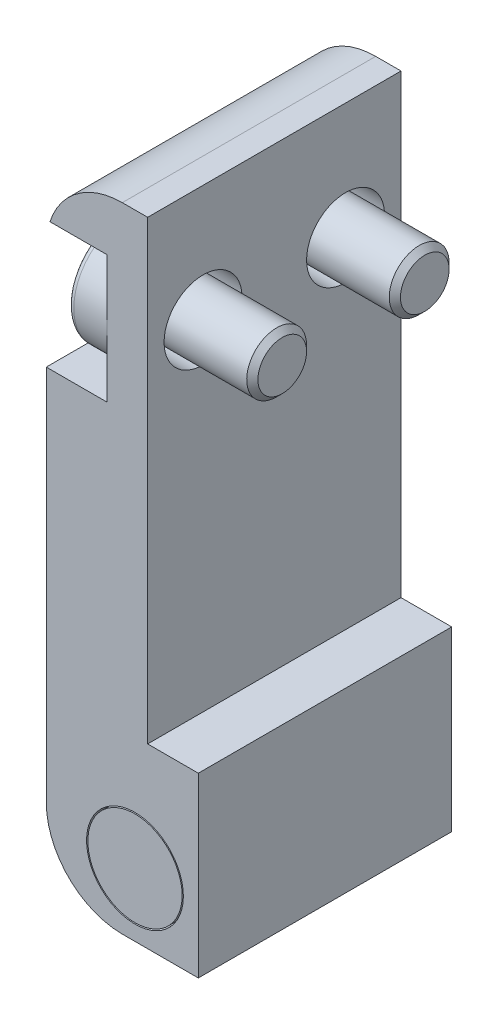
ISO-10303-21;
HEADER;
FILE_DESCRIPTION(('STEP AP214'),'2;1');
FILE_NAME('part.step','',(''),(''),'','','');
FILE_SCHEMA(('AUTOMOTIVE_DESIGN { 1 0 10303 214 1 1 1 1 }'));
ENDSEC;
DATA;
#1=APPLICATION_CONTEXT('core data for automotive mechanical design processes');
#2=APPLICATION_PROTOCOL_DEFINITION('international standard','automotive_design',2000,#1);
#3=PRODUCT_CONTEXT('',#1,'mechanical');
#4=PRODUCT('Part','Part','',(#3));
#5=PRODUCT_RELATED_PRODUCT_CATEGORY('part','',(#4));
#6=PRODUCT_DEFINITION_FORMATION('','',#4);
#7=PRODUCT_DEFINITION_CONTEXT('part definition',#1,'design');
#8=PRODUCT_DEFINITION('design','',#6,#7);
#9=PRODUCT_DEFINITION_SHAPE('','',#8);
#10=(LENGTH_UNIT() NAMED_UNIT(*) SI_UNIT(.MILLI.,.METRE.));
#11=(NAMED_UNIT(*) PLANE_ANGLE_UNIT() SI_UNIT($,.RADIAN.));
#12=(NAMED_UNIT(*) SI_UNIT($,.STERADIAN.) SOLID_ANGLE_UNIT());
#13=UNCERTAINTY_MEASURE_WITH_UNIT(LENGTH_MEASURE(1.E-05),#10,'distance_accuracy_value','');
#14=(GEOMETRIC_REPRESENTATION_CONTEXT(3) GLOBAL_UNCERTAINTY_ASSIGNED_CONTEXT((#13)) GLOBAL_UNIT_ASSIGNED_CONTEXT((#10,
#11,#12)) REPRESENTATION_CONTEXT('',''));
#15=CARTESIAN_POINT('',(0.,0.,0.));
#16=DIRECTION('',(0.,0.,1.));
#17=DIRECTION('',(1.,0.,0.));
#18=AXIS2_PLACEMENT_3D('',#15,#16,#17);
#19=CARTESIAN_POINT('',(1.905,3.175,6.35));
#20=DIRECTION('',(0.,0.,-1.));
#21=DIRECTION('',(-1.,0.,0.));
#22=AXIS2_PLACEMENT_3D('',#19,#20,#21);
#23=CYLINDRICAL_SURFACE('',#22,2.3622);
#24=CARTESIAN_POINT('',(1.905,3.175,6.35));
#25=DIRECTION('',(0.,0.,1.));
#26=DIRECTION('',(1.,0.,0.));
#27=AXIS2_PLACEMENT_3D('',#24,#25,#26);
#28=CIRCLE('',#27,2.3622);
#29=CARTESIAN_POINT('',(4.2672,3.175,6.35));
#30=VERTEX_POINT('',#29);
#31=EDGE_CURVE('P0_E9',#30,#30,#28,.T.);
#32=ORIENTED_EDGE('',*,*,#31,.F.);
#33=EDGE_LOOP('',(#32));
#34=FACE_BOUND('',#33,.T.);
#35=CARTESIAN_POINT('',(1.905,3.175,-6.35));
#36=DIRECTION('',(0.,0.,1.));
#37=DIRECTION('',(1.,0.,0.));
#38=AXIS2_PLACEMENT_3D('',#35,#36,#37);
#39=CIRCLE('',#38,2.3622);
#40=CARTESIAN_POINT('',(4.2672,3.175,-6.35));
#41=VERTEX_POINT('',#40);
#42=EDGE_CURVE('P0_E19',#41,#41,#39,.T.);
#43=ORIENTED_EDGE('',*,*,#42,.T.);
#44=EDGE_LOOP('',(#43));
#45=FACE_BOUND('',#44,.T.);
#46=ADVANCED_FACE('P0_F13',(#34,#45),#23,.T.);
#47=CARTESIAN_POINT('',(1.905,3.175,6.35));
#48=DIRECTION('',(0.,0.,1.));
#49=DIRECTION('',(1.,0.,0.));
#50=AXIS2_PLACEMENT_3D('',#47,#48,#49);
#51=PLANE('',#50);
#52=ORIENTED_EDGE('',*,*,#31,.T.);
#53=EDGE_LOOP('',(#52));
#54=FACE_BOUND('',#53,.T.);
#55=ADVANCED_FACE('P0_F28',(#54),#51,.T.);
#56=CARTESIAN_POINT('',(1.905,3.175,-6.35));
#57=DIRECTION('',(0.,0.,1.));
#58=DIRECTION('',(1.,0.,0.));
#59=AXIS2_PLACEMENT_3D('',#56,#57,#58);
#60=PLANE('',#59);
#61=ORIENTED_EDGE('',*,*,#42,.F.);
#62=EDGE_LOOP('',(#61));
#63=FACE_BOUND('',#62,.T.);
#64=ADVANCED_FACE('P0_F26',(#63),#60,.F.);
#65=CLOSED_SHELL('',(#46,#55,#64));
#66=MANIFOLD_SOLID_BREP('P0_B1',#65);
#67=CARTESIAN_POINT('',(-11.297738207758,22.708,3.571875));
#68=DIRECTION('',(0.,1.,0.));
#69=DIRECTION('',(0.,0.,1.));
#70=AXIS2_PLACEMENT_3D('',#67,#68,#69);
#71=PLANE('',#70);
#72=DIRECTION('',(1.,0.,0.));
#73=VECTOR('',#72,1.);
#74=CARTESIAN_POINT('',(-11.297738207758,22.708,6.35));
#75=LINE('',#74,#73);
#76=CARTESIAN_POINT('',(-2.54,22.708,6.35));
#77=VERTEX_POINT('',#76);
#78=CARTESIAN_POINT('',(0.508,22.708,6.35));
#79=VERTEX_POINT('',#78);
#80=EDGE_CURVE('P1_E200',#77,#79,#75,.T.);
#81=ORIENTED_EDGE('',*,*,#80,.T.);
#82=DIRECTION('',(0.,0.,1.));
#83=VECTOR('',#82,1.);
#84=CARTESIAN_POINT('',(0.508,22.708,3.571875));
#85=LINE('',#84,#83);
#86=CARTESIAN_POINT('',(0.508,22.708,3.571875));
#87=VERTEX_POINT('',#86);
#88=EDGE_CURVE('P1_E211',#87,#79,#85,.T.);
#89=ORIENTED_EDGE('',*,*,#88,.F.);
#90=DIRECTION('',(1.,0.,0.));
#91=VECTOR('',#90,1.);
#92=CARTESIAN_POINT('',(-11.297738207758,22.708,3.571875));
#93=LINE('',#92,#91);
#94=CARTESIAN_POINT('',(-2.54,22.708,3.571875));
#95=VERTEX_POINT('',#94);
#96=EDGE_CURVE('P1_E214',#95,#87,#93,.T.);
#97=ORIENTED_EDGE('',*,*,#96,.F.);
#98=DIRECTION('',(0.,0.,-1.));
#99=VECTOR('',#98,1.);
#100=CARTESIAN_POINT('',(-2.54,22.708,3.571875));
#101=LINE('',#100,#99);
#102=EDGE_CURVE('P1_E19',#77,#95,#101,.T.);
#103=ORIENTED_EDGE('',*,*,#102,.F.);
#104=EDGE_LOOP('',(#81,#89,#97,#103));
#105=FACE_BOUND('',#104,.T.);
#106=ADVANCED_FACE('P1_F15',(#105),#71,.T.);
#107=CARTESIAN_POINT('',(-2.54,25.908,3.571875));
#108=DIRECTION('',(-1.,0.,0.));
#109=DIRECTION('',(0.,0.,1.));
#110=AXIS2_PLACEMENT_3D('',#107,#108,#109);
#111=CYLINDRICAL_SURFACE('',#110,3.2);
#112=DIRECTION('',(1.,0.,0.));
#113=VECTOR('',#112,1.);
#114=CARTESIAN_POINT('',(-11.297738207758,29.108,3.571875));
#115=LINE('',#114,#113);
#116=CARTESIAN_POINT('',(-2.35655153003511,29.108,3.571875));
#117=VERTEX_POINT('',#116);
#118=CARTESIAN_POINT('',(0.508,29.108,3.571875));
#119=VERTEX_POINT('',#118);
#120=EDGE_CURVE('P1_E225',#117,#119,#115,.T.);
#121=ORIENTED_EDGE('',*,*,#120,.F.);
#122=CARTESIAN_POINT('',(-2.35655153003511,29.108,3.571875));
#123=CARTESIAN_POINT('',(-2.35652235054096,29.1080113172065,3.48315175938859));
#124=CARTESIAN_POINT('',(-2.35773927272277,29.104310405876,3.39443879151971));
#125=CARTESIAN_POINT('',(-2.36244946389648,29.0895736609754,3.21771470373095));
#126=CARTESIAN_POINT('',(-2.36594194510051,29.0785403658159,3.12970335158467));
#127=CARTESIAN_POINT('',(-2.37498141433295,29.0492485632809,2.95512242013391));
#128=CARTESIAN_POINT('',(-2.38052555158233,29.0310000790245,2.8685510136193));
#129=CARTESIAN_POINT('',(-2.3932583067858,28.9874492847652,2.69734541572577));
#130=CARTESIAN_POINT('',(-2.40044700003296,28.9621466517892,2.61271131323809));
#131=CARTESIAN_POINT('',(-2.42373225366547,28.8759622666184,2.36264980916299));
#132=CARTESIAN_POINT('',(-2.44156298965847,28.8047628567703,2.20082030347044));
#133=CARTESIAN_POINT('',(-2.47671460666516,28.6368053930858,1.89121184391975));
#134=CARTESIAN_POINT('',(-2.49403599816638,28.5400739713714,1.74341846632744));
#135=CARTESIAN_POINT('',(-2.51753352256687,28.3595027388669,1.51179607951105));
#136=CARTESIAN_POINT('',(-2.52550009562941,28.2821196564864,1.42307111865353));
#137=CARTESIAN_POINT('',(-2.53673400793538,28.1179155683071,1.25451486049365));
#138=CARTESIAN_POINT('',(-2.54000115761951,28.0310941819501,1.17468392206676));
#139=CARTESIAN_POINT('',(-2.54,27.94,1.09983616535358));
#140=B_SPLINE_CURVE_WITH_KNOTS('',3,(#122,#123,#124,#125,#126,#127,#128,#129,#130,#131,#132,
#133,#134,#135,#136,#137,#138,#139),.UNSPECIFIED.,.F.,.F.,(4,2,2,2,2,2,2,2,4),(0.,
0.266067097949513,0.532042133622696,0.797648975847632,1.06326798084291,1.59377480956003,
2.12373044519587,2.47697262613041,2.83022905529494),.UNSPECIFIED.);
#141=CARTESIAN_POINT('',(-2.54,27.94,1.09983616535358));
#142=VERTEX_POINT('',#141);
#143=EDGE_CURVE('P1_E519',#117,#142,#140,.T.);
#144=ORIENTED_EDGE('',*,*,#143,.T.);
#145=CARTESIAN_POINT('',(-2.54,25.908,3.571875));
#146=DIRECTION('',(-1.,0.,0.));
#147=DIRECTION('',(0.,0.,1.));
#148=AXIS2_PLACEMENT_3D('',#145,#146,#147);
#149=CIRCLE('',#148,3.2);
#150=EDGE_CURVE('P1_E259',#142,#95,#149,.T.);
#151=ORIENTED_EDGE('',*,*,#150,.T.);
#152=ORIENTED_EDGE('',*,*,#96,.T.);
#153=CARTESIAN_POINT('',(0.508,25.908,3.571875));
#154=DIRECTION('',(-1.,0.,0.));
#155=DIRECTION('',(0.,0.,1.));
#156=AXIS2_PLACEMENT_3D('',#153,#154,#155);
#157=CIRCLE('',#156,3.2);
#158=EDGE_CURVE('P1_E219',#119,#87,#157,.T.);
#159=ORIENTED_EDGE('',*,*,#158,.F.);
#160=EDGE_LOOP('',(#121,#144,#151,#152,#159));
#161=FACE_BOUND('',#160,.T.);
#162=ADVANCED_FACE('P1_F364',(#161),#111,.F.);
#163=CARTESIAN_POINT('',(-11.297738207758,29.108,6.35));
#164=DIRECTION('',(0.,-1.,0.));
#165=DIRECTION('',(0.,0.,-1.));
#166=AXIS2_PLACEMENT_3D('',#163,#164,#165);
#167=PLANE('',#166);
#168=DIRECTION('',(1.,0.,0.));
#169=VECTOR('',#168,1.);
#170=CARTESIAN_POINT('',(-11.297738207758,29.108,6.35));
#171=LINE('',#170,#169);
#172=CARTESIAN_POINT('',(-2.35655153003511,29.108,6.35));
#173=VERTEX_POINT('',#172);
#174=CARTESIAN_POINT('',(0.508,29.108,6.35));
#175=VERTEX_POINT('',#174);
#176=EDGE_CURVE('P1_E192',#173,#175,#171,.T.);
#177=ORIENTED_EDGE('',*,*,#176,.F.);
#178=DIRECTION('',(0.,0.,-1.));
#179=VECTOR('',#178,1.);
#180=CARTESIAN_POINT('',(-2.35655153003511,29.108,6.35));
#181=LINE('',#180,#179);
#182=EDGE_CURVE('P1_E525',#173,#117,#181,.T.);
#183=ORIENTED_EDGE('',*,*,#182,.T.);
#184=ORIENTED_EDGE('',*,*,#120,.T.);
#185=DIRECTION('',(0.,0.,-1.));
#186=VECTOR('',#185,1.);
#187=CARTESIAN_POINT('',(0.508,29.108,6.35));
#188=LINE('',#187,#186);
#189=EDGE_CURVE('P1_E221',#175,#119,#188,.T.);
#190=ORIENTED_EDGE('',*,*,#189,.F.);
#191=EDGE_LOOP('',(#177,#183,#184,#190));
#192=FACE_BOUND('',#191,.T.);
#193=ADVANCED_FACE('P1_F17',(#192),#167,.T.);
#194=CARTESIAN_POINT('',(2.54,0.,6.35));
#195=DIRECTION('',(0.,0.,1.));
#196=DIRECTION('',(1.,0.,0.));
#197=AXIS2_PLACEMENT_3D('',#194,#195,#196);
#198=PLANE('',#197);
#199=DIRECTION('',(0.,-1.,0.));
#200=VECTOR('',#199,1.);
#201=CARTESIAN_POINT('',(-2.54,0.,6.35));
#202=LINE('',#201,#200);
#203=CARTESIAN_POINT('',(-2.54,3.81,6.35));
#204=VERTEX_POINT('',#203);
#205=EDGE_CURVE('P1_E285',#77,#204,#202,.T.);
#206=ORIENTED_EDGE('',*,*,#205,.T.);
#207=CARTESIAN_POINT('',(1.27,3.81,6.35));
#208=DIRECTION('',(0.,0.,1.));
#209=DIRECTION('',(1.,0.,0.));
#210=AXIS2_PLACEMENT_3D('',#207,#208,#209);
#211=CIRCLE('',#210,3.81);
#212=CARTESIAN_POINT('',(1.27,0.,6.35));
#213=VERTEX_POINT('',#212);
#214=EDGE_CURVE('P1_E330',#204,#213,#211,.T.);
#215=ORIENTED_EDGE('',*,*,#214,.T.);
#216=DIRECTION('',(1.,0.,0.));
#217=VECTOR('',#216,1.);
#218=CARTESIAN_POINT('',(5.08,0.,6.35));
#219=LINE('',#218,#217);
#220=CARTESIAN_POINT('',(5.08,0.,6.35));
#221=VERTEX_POINT('',#220);
#222=EDGE_CURVE('P1_E273',#213,#221,#219,.T.);
#223=ORIENTED_EDGE('',*,*,#222,.T.);
#224=DIRECTION('',(0.,1.,0.));
#225=VECTOR('',#224,1.);
#226=CARTESIAN_POINT('',(5.08,8.89,6.35));
#227=LINE('',#226,#225);
#228=CARTESIAN_POINT('',(5.08,8.89,6.35));
#229=VERTEX_POINT('',#228);
#230=EDGE_CURVE('P1_E276',#221,#229,#227,.T.);
#231=ORIENTED_EDGE('',*,*,#230,.T.);
#232=DIRECTION('',(-1.,0.,0.));
#233=VECTOR('',#232,1.);
#234=CARTESIAN_POINT('',(2.54,8.89,6.35));
#235=LINE('',#234,#233);
#236=CARTESIAN_POINT('',(2.54,8.89,6.35));
#237=VERTEX_POINT('',#236);
#238=EDGE_CURVE('P1_E278',#229,#237,#235,.T.);
#239=ORIENTED_EDGE('',*,*,#238,.T.);
#240=DIRECTION('',(0.,1.,0.));
#241=VECTOR('',#240,1.);
#242=CARTESIAN_POINT('',(2.54,31.75,6.35));
#243=LINE('',#242,#241);
#244=CARTESIAN_POINT('',(2.54,31.75,6.35));
#245=VERTEX_POINT('',#244);
#246=EDGE_CURVE('P1_E280',#237,#245,#243,.T.);
#247=ORIENTED_EDGE('',*,*,#246,.T.);
#248=DIRECTION('',(-1.,0.,0.));
#249=VECTOR('',#248,1.);
#250=CARTESIAN_POINT('',(-2.54,31.75,6.35));
#251=LINE('',#250,#249);
#252=CARTESIAN_POINT('',(1.27,31.75,6.35));
#253=VERTEX_POINT('',#252);
#254=EDGE_CURVE('P1_E282',#245,#253,#251,.T.);
#255=ORIENTED_EDGE('',*,*,#254,.T.);
#256=CARTESIAN_POINT('',(1.27,27.94,6.35));
#257=DIRECTION('',(0.,0.,1.));
#258=DIRECTION('',(1.,0.,0.));
#259=AXIS2_PLACEMENT_3D('',#256,#257,#258);
#260=CIRCLE('',#259,3.81);
#261=EDGE_CURVE('P1_E328',#253,#173,#260,.T.);
#262=ORIENTED_EDGE('',*,*,#261,.T.);
#263=ORIENTED_EDGE('',*,*,#176,.T.);
#264=DIRECTION('',(0.,1.,0.));
#265=VECTOR('',#264,1.);
#266=CARTESIAN_POINT('',(0.508,0.,6.35));
#267=LINE('',#266,#265);
#268=EDGE_CURVE('P1_E195',#79,#175,#267,.T.);
#269=ORIENTED_EDGE('',*,*,#268,.F.);
#270=ORIENTED_EDGE('',*,*,#80,.F.);
#271=EDGE_LOOP('',(#206,#215,#223,#231,#239,#247,#255,#262,#263,#269,#270));
#272=FACE_BOUND('',#271,.T.);
#273=CARTESIAN_POINT('',(1.905,3.175,6.35));
#274=DIRECTION('',(0.,0.,1.));
#275=DIRECTION('',(1.,0.,0.));
#276=AXIS2_PLACEMENT_3D('',#273,#274,#275);
#277=CIRCLE('',#276,2.4257);
#278=CARTESIAN_POINT('',(4.3307,3.175,6.35));
#279=VERTEX_POINT('',#278);
#280=EDGE_CURVE('P1_E266',#279,#279,#277,.T.);
#281=ORIENTED_EDGE('',*,*,#280,.F.);
#282=EDGE_LOOP('',(#281));
#283=FACE_BOUND('',#282,.T.);
#284=ADVANCED_FACE('P1_F198',(#272,#283),#198,.T.);
#285=CARTESIAN_POINT('',(0.508,27.863,3.571875));
#286=DIRECTION('',(1.,0.,0.));
#287=DIRECTION('',(0.,0.,-1.));
#288=AXIS2_PLACEMENT_3D('',#285,#286,#287);
#289=PLANE('',#288);
#290=CARTESIAN_POINT('',(0.508,25.908,3.571875));
#291=DIRECTION('',(-1.,0.,0.));
#292=DIRECTION('',(0.,0.5,-0.866025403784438));
#293=AXIS2_PLACEMENT_3D('',#290,#291,#292);
#294=CIRCLE('',#293,2.75);
#295=CARTESIAN_POINT('',(0.508,27.283,1.1903051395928));
#296=VERTEX_POINT('',#295);
#297=EDGE_CURVE('P1_E1231',#296,#296,#294,.T.);
#298=ORIENTED_EDGE('',*,*,#297,.F.);
#299=EDGE_LOOP('',(#298));
#300=FACE_BOUND('',#299,.T.);
#301=ORIENTED_EDGE('',*,*,#268,.T.);
#302=ORIENTED_EDGE('',*,*,#189,.T.);
#303=ORIENTED_EDGE('',*,*,#158,.T.);
#304=ORIENTED_EDGE('',*,*,#88,.T.);
#305=EDGE_LOOP('',(#301,#302,#303,#304));
#306=FACE_BOUND('',#305,.T.);
#307=ADVANCED_FACE('P1_F217',(#300,#306),#289,.F.);
#308=CARTESIAN_POINT('',(5.08,8.89,6.35));
#309=DIRECTION('',(-1.,0.,0.));
#310=DIRECTION('',(0.,-1.,0.));
#311=AXIS2_PLACEMENT_3D('',#308,#309,#310);
#312=PLANE('',#311);
#313=DIRECTION('',(0.,1.,0.));
#314=VECTOR('',#313,1.);
#315=CARTESIAN_POINT('',(5.08,8.89,-6.35));
#316=LINE('',#315,#314);
#317=CARTESIAN_POINT('',(5.08,0.,-6.35));
#318=VERTEX_POINT('',#317);
#319=CARTESIAN_POINT('',(5.08,8.89,-6.35));
#320=VERTEX_POINT('',#319);
#321=EDGE_CURVE('P1_E289',#318,#320,#316,.T.);
#322=ORIENTED_EDGE('',*,*,#321,.T.);
#323=DIRECTION('',(0.,0.,-1.));
#324=VECTOR('',#323,1.);
#325=CARTESIAN_POINT('',(5.08,8.89,6.35));
#326=LINE('',#325,#324);
#327=EDGE_CURVE('P1_E305',#229,#320,#326,.T.);
#328=ORIENTED_EDGE('',*,*,#327,.F.);
#329=ORIENTED_EDGE('',*,*,#230,.F.);
#330=DIRECTION('',(0.,0.,-1.));
#331=VECTOR('',#330,1.);
#332=CARTESIAN_POINT('',(5.08,0.,6.35));
#333=LINE('',#332,#331);
#334=EDGE_CURVE('P1_E206',#221,#318,#333,.T.);
#335=ORIENTED_EDGE('',*,*,#334,.T.);
#336=EDGE_LOOP('',(#322,#328,#329,#335));
#337=FACE_BOUND('',#336,.T.);
#338=ADVANCED_FACE('P1_F595',(#337),#312,.F.);
#339=CARTESIAN_POINT('',(2.54,8.89,6.35));
#340=DIRECTION('',(0.,-1.,0.));
#341=DIRECTION('',(0.,0.,-1.));
#342=AXIS2_PLACEMENT_3D('',#339,#340,#341);
#343=PLANE('',#342);
#344=DIRECTION('',(-1.,0.,0.));
#345=VECTOR('',#344,1.);
#346=CARTESIAN_POINT('',(2.54,8.89,-6.35));
#347=LINE('',#346,#345);
#348=CARTESIAN_POINT('',(2.54,8.89,-6.35));
#349=VERTEX_POINT('',#348);
#350=EDGE_CURVE('P1_E291',#320,#349,#347,.T.);
#351=ORIENTED_EDGE('',*,*,#350,.T.);
#352=DIRECTION('',(0.,0.,-1.));
#353=VECTOR('',#352,1.);
#354=CARTESIAN_POINT('',(2.54,8.89,6.35));
#355=LINE('',#354,#353);
#356=EDGE_CURVE('P1_E302',#237,#349,#355,.T.);
#357=ORIENTED_EDGE('',*,*,#356,.F.);
#358=ORIENTED_EDGE('',*,*,#238,.F.);
#359=ORIENTED_EDGE('',*,*,#327,.T.);
#360=EDGE_LOOP('',(#351,#357,#358,#359));
#361=FACE_BOUND('',#360,.T.);
#362=ADVANCED_FACE('P1_F541',(#361),#343,.F.);
#363=CARTESIAN_POINT('',(2.54,31.75,6.35));
#364=DIRECTION('',(-1.,0.,0.));
#365=DIRECTION('',(0.,-1.,0.));
#366=AXIS2_PLACEMENT_3D('',#363,#364,#365);
#367=PLANE('',#366);
#368=CARTESIAN_POINT('',(2.54,25.908,-3.571875));
#369=DIRECTION('',(-1.,0.,0.));
#370=DIRECTION('',(0.,-1.,0.));
#371=AXIS2_PLACEMENT_3D('',#368,#369,#370);
#372=CIRCLE('',#371,1.955);
#373=CARTESIAN_POINT('',(2.54,23.953,-3.571875));
#374=VERTEX_POINT('',#373);
#375=EDGE_CURVE('P1_E258',#374,#374,#372,.T.);
#376=ORIENTED_EDGE('',*,*,#375,.T.);
#377=EDGE_LOOP('',(#376));
#378=FACE_BOUND('',#377,.T.);
#379=CARTESIAN_POINT('',(2.54,25.908,3.571875));
#380=DIRECTION('',(-1.,0.,0.));
#381=DIRECTION('',(0.,-1.,0.));
#382=AXIS2_PLACEMENT_3D('',#379,#380,#381);
#383=CIRCLE('',#382,1.955);
#384=CARTESIAN_POINT('',(2.54,23.953,3.571875));
#385=VERTEX_POINT('',#384);
#386=EDGE_CURVE('P1_E265',#385,#385,#383,.T.);
#387=ORIENTED_EDGE('',*,*,#386,.T.);
#388=EDGE_LOOP('',(#387));
#389=FACE_BOUND('',#388,.T.);
#390=DIRECTION('',(0.,1.,0.));
#391=VECTOR('',#390,1.);
#392=CARTESIAN_POINT('',(2.54,31.75,-6.35));
#393=LINE('',#392,#391);
#394=CARTESIAN_POINT('',(2.54,31.75,-6.35));
#395=VERTEX_POINT('',#394);
#396=EDGE_CURVE('P1_E293',#349,#395,#393,.T.);
#397=ORIENTED_EDGE('',*,*,#396,.T.);
#398=DIRECTION('',(0.,0.,-1.));
#399=VECTOR('',#398,1.);
#400=CARTESIAN_POINT('',(2.54,31.75,6.35));
#401=LINE('',#400,#399);
#402=EDGE_CURVE('P1_E287',#245,#395,#401,.T.);
#403=ORIENTED_EDGE('',*,*,#402,.F.);
#404=ORIENTED_EDGE('',*,*,#246,.F.);
#405=ORIENTED_EDGE('',*,*,#356,.T.);
#406=EDGE_LOOP('',(#397,#403,#404,#405));
#407=FACE_BOUND('',#406,.T.);
#408=ADVANCED_FACE('P1_F533',(#378,#389,#407),#367,.F.);
#409=CARTESIAN_POINT('',(-2.54,25.908,-3.571875));
#410=DIRECTION('',(-1.,0.,0.));
#411=DIRECTION('',(0.,0.,1.));
#412=AXIS2_PLACEMENT_3D('',#409,#410,#411);
#413=CYLINDRICAL_SURFACE('',#412,1.955);
#414=CARTESIAN_POINT('',(0.508,25.908,-3.571875));
#415=DIRECTION('',(-1.,0.,0.));
#416=DIRECTION('',(0.,0.,1.));
#417=AXIS2_PLACEMENT_3D('',#414,#415,#416);
#418=CIRCLE('',#417,1.955);
#419=CARTESIAN_POINT('',(0.508,25.908,-1.616875));
#420=VERTEX_POINT('',#419);
#421=EDGE_CURVE('P1_E255',#420,#420,#418,.T.);
#422=ORIENTED_EDGE('',*,*,#421,.T.);
#423=EDGE_LOOP('',(#422));
#424=FACE_BOUND('',#423,.T.);
#425=ORIENTED_EDGE('',*,*,#375,.F.);
#426=EDGE_LOOP('',(#425));
#427=FACE_BOUND('',#426,.T.);
#428=ADVANCED_FACE('P1_F530',(#424,#427),#413,.F.);
#429=CARTESIAN_POINT('',(-2.54,25.908,3.571875));
#430=DIRECTION('',(-1.,0.,0.));
#431=DIRECTION('',(0.,0.,1.));
#432=AXIS2_PLACEMENT_3D('',#429,#430,#431);
#433=CYLINDRICAL_SURFACE('',#432,1.955);
#434=CARTESIAN_POINT('',(0.508,25.908,3.571875));
#435=DIRECTION('',(-1.,0.,0.));
#436=DIRECTION('',(0.,0.,1.));
#437=AXIS2_PLACEMENT_3D('',#434,#435,#436);
#438=CIRCLE('',#437,1.955);
#439=CARTESIAN_POINT('',(0.508,25.908,5.526875));
#440=VERTEX_POINT('',#439);
#441=EDGE_CURVE('P1_E262',#440,#440,#438,.T.);
#442=ORIENTED_EDGE('',*,*,#441,.T.);
#443=EDGE_LOOP('',(#442));
#444=FACE_BOUND('',#443,.T.);
#445=ORIENTED_EDGE('',*,*,#386,.F.);
#446=EDGE_LOOP('',(#445));
#447=FACE_BOUND('',#446,.T.);
#448=ADVANCED_FACE('P1_F532',(#444,#447),#433,.F.);
#449=CARTESIAN_POINT('',(-2.54,31.75,6.35));
#450=DIRECTION('',(0.,-1.,0.));
#451=DIRECTION('',(0.,0.,-1.));
#452=AXIS2_PLACEMENT_3D('',#449,#450,#451);
#453=PLANE('',#452);
#454=DIRECTION('',(-1.,0.,0.));
#455=VECTOR('',#454,1.);
#456=CARTESIAN_POINT('',(-2.54,31.75,-6.35));
#457=LINE('',#456,#455);
#458=CARTESIAN_POINT('',(1.27,31.75,-6.35));
#459=VERTEX_POINT('',#458);
#460=EDGE_CURVE('P1_E295',#395,#459,#457,.T.);
#461=ORIENTED_EDGE('',*,*,#460,.T.);
#462=DIRECTION('',(0.,0.,-1.));
#463=VECTOR('',#462,1.);
#464=CARTESIAN_POINT('',(1.27,31.75,6.35));
#465=LINE('',#464,#463);
#466=EDGE_CURVE('P1_E566',#459,#253,#465,.F.);
#467=ORIENTED_EDGE('',*,*,#466,.T.);
#468=ORIENTED_EDGE('',*,*,#254,.F.);
#469=ORIENTED_EDGE('',*,*,#402,.T.);
#470=EDGE_LOOP('',(#461,#467,#468,#469));
#471=FACE_BOUND('',#470,.T.);
#472=ADVANCED_FACE('P1_F539',(#471),#453,.F.);
#473=CARTESIAN_POINT('',(1.27,27.94,6.35));
#474=DIRECTION('',(0.,0.,-1.));
#475=DIRECTION('',(-1.,0.,0.));
#476=AXIS2_PLACEMENT_3D('',#473,#474,#475);
#477=CYLINDRICAL_SURFACE('',#476,3.81);
#478=ORIENTED_EDGE('',*,*,#261,.F.);
#479=ORIENTED_EDGE('',*,*,#466,.F.);
#480=CARTESIAN_POINT('',(1.27,27.94,-6.35));
#481=DIRECTION('',(0.,0.,1.));
#482=DIRECTION('',(1.,0.,0.));
#483=AXIS2_PLACEMENT_3D('',#480,#481,#482);
#484=CIRCLE('',#483,3.81);
#485=CARTESIAN_POINT('',(-2.35655153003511,29.108,-6.35));
#486=VERTEX_POINT('',#485);
#487=EDGE_CURVE('P1_E319',#486,#459,#484,.F.);
#488=ORIENTED_EDGE('',*,*,#487,.F.);
#489=DIRECTION('',(0.,0.,-1.));
#490=VECTOR('',#489,1.);
#491=CARTESIAN_POINT('',(-2.35655153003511,29.108,-3.571875));
#492=LINE('',#491,#490);
#493=CARTESIAN_POINT('',(-2.35655153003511,29.108,-3.571875));
#494=VERTEX_POINT('',#493);
#495=EDGE_CURVE('P1_E340',#494,#486,#492,.T.);
#496=ORIENTED_EDGE('',*,*,#495,.F.);
#497=CARTESIAN_POINT('',(-2.54,27.94,-1.09983616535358));
#498=CARTESIAN_POINT('',(-2.54000225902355,28.0085187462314,-1.15614357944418));
#499=CARTESIAN_POINT('',(-2.53815191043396,28.0746550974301,-1.21529382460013));
#500=CARTESIAN_POINT('',(-2.5315336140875,28.2016859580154,-1.33875491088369));
#501=CARTESIAN_POINT('',(-2.52676757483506,28.2625838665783,-1.40306235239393));
#502=CARTESIAN_POINT('',(-2.51510699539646,28.3787163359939,-1.53634727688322));
#503=CARTESIAN_POINT('',(-2.50821374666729,28.4339543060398,-1.60532190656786));
#504=CARTESIAN_POINT('',(-2.49307227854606,28.5384765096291,-1.7474887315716));
#505=CARTESIAN_POINT('',(-2.48482386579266,28.5877598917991,-1.8206815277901));
#506=CARTESIAN_POINT('',(-2.45920435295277,28.7260910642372,-2.04567554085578));
#507=CARTESIAN_POINT('',(-2.44092549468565,28.8058872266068,-2.20320019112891));
#508=CARTESIAN_POINT('',(-2.4074741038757,28.9385030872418,-2.52928699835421));
#509=CARTESIAN_POINT('',(-2.392297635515,28.9913570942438,-2.69783480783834));
#510=CARTESIAN_POINT('',(-2.37302249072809,29.0558779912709,-2.98471415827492));
#511=CARTESIAN_POINT('',(-2.36691948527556,29.0753890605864,-3.10118132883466));
#512=CARTESIAN_POINT('',(-2.36073917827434,29.0949360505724,-3.27704840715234));
#513=CARTESIAN_POINT('',(-2.35917475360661,29.0998317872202,-3.33588287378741));
#514=CARTESIAN_POINT('',(-2.35707836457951,29.1063648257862,-3.45376650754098));
#515=CARTESIAN_POINT('',(-2.35654667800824,29.1080012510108,-3.51281572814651));
#516=CARTESIAN_POINT('',(-2.35655153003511,29.108,-3.571875));
#517=B_SPLINE_CURVE_WITH_KNOTS('',3,(#497,#498,#499,#500,#501,#502,#503,#504,#505,#506,#507,
#508,#509,#510,#511,#512,#513,#514,#515,#516),.UNSPECIFIED.,.F.,.F.,(4,2,2,2,2,2,2,2,2,4),(0.,
0.26591204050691,0.531650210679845,0.797227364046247,1.06284244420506,1.59286034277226,
2.1222016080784,2.47616121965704,2.65324668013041,2.83037976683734),.UNSPECIFIED.);
#518=CARTESIAN_POINT('',(-2.54,27.94,-1.09983616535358));
#519=VERTEX_POINT('',#518);
#520=EDGE_CURVE('P1_E332',#519,#494,#517,.T.);
#521=ORIENTED_EDGE('',*,*,#520,.F.);
#522=DIRECTION('',(0.,0.,-1.));
#523=VECTOR('',#522,1.);
#524=CARTESIAN_POINT('',(-2.54,27.94,6.35));
#525=LINE('',#524,#523);
#526=EDGE_CURVE('P1_E323',#142,#519,#525,.T.);
#527=ORIENTED_EDGE('',*,*,#526,.F.);
#528=ORIENTED_EDGE('',*,*,#143,.F.);
#529=ORIENTED_EDGE('',*,*,#182,.F.);
#530=EDGE_LOOP('',(#478,#479,#488,#496,#521,#527,#528,#529));
#531=FACE_BOUND('',#530,.T.);
#532=ADVANCED_FACE('P1_F342',(#531),#477,.T.);
#533=CARTESIAN_POINT('',(-2.54,0.,6.35));
#534=DIRECTION('',(1.,0.,0.));
#535=DIRECTION('',(0.,0.,-1.));
#536=AXIS2_PLACEMENT_3D('',#533,#534,#535);
#537=PLANE('',#536);
#538=DIRECTION('',(0.,-1.,0.));
#539=VECTOR('',#538,1.);
#540=CARTESIAN_POINT('',(-2.54,0.,-6.35));
#541=LINE('',#540,#539);
#542=CARTESIAN_POINT('',(-2.54,22.708,-6.35));
#543=VERTEX_POINT('',#542);
#544=CARTESIAN_POINT('',(-2.54,3.81,-6.35));
#545=VERTEX_POINT('',#544);
#546=EDGE_CURVE('P1_E275',#543,#545,#541,.T.);
#547=ORIENTED_EDGE('',*,*,#546,.T.);
#548=DIRECTION('',(0.,0.,-1.));
#549=VECTOR('',#548,1.);
#550=CARTESIAN_POINT('',(-2.54,3.81,6.35));
#551=LINE('',#550,#549);
#552=EDGE_CURVE('P1_E326',#545,#204,#551,.F.);
#553=ORIENTED_EDGE('',*,*,#552,.T.);
#554=ORIENTED_EDGE('',*,*,#205,.F.);
#555=ORIENTED_EDGE('',*,*,#102,.T.);
#556=ORIENTED_EDGE('',*,*,#150,.F.);
#557=ORIENTED_EDGE('',*,*,#526,.T.);
#558=CARTESIAN_POINT('',(-2.54,25.908,-3.571875));
#559=DIRECTION('',(-1.,0.,0.));
#560=DIRECTION('',(0.,0.,1.));
#561=AXIS2_PLACEMENT_3D('',#558,#559,#560);
#562=CIRCLE('',#561,3.2);
#563=CARTESIAN_POINT('',(-2.54,22.708,-3.571875));
#564=VERTEX_POINT('',#563);
#565=EDGE_CURVE('P1_E249',#564,#519,#562,.T.);
#566=ORIENTED_EDGE('',*,*,#565,.F.);
#567=DIRECTION('',(0.,0.,-1.));
#568=VECTOR('',#567,1.);
#569=CARTESIAN_POINT('',(-2.54,22.708,-3.571875));
#570=LINE('',#569,#568);
#571=EDGE_CURVE('P1_E246',#564,#543,#570,.T.);
#572=ORIENTED_EDGE('',*,*,#571,.T.);
#573=EDGE_LOOP('',(#547,#553,#554,#555,#556,#557,#566,#572));
#574=FACE_BOUND('',#573,.T.);
#575=ADVANCED_FACE('P1_F575',(#574),#537,.F.);
#576=CARTESIAN_POINT('',(1.27,3.81,6.35));
#577=DIRECTION('',(0.,0.,-1.));
#578=DIRECTION('',(-1.,0.,0.));
#579=AXIS2_PLACEMENT_3D('',#576,#577,#578);
#580=CYLINDRICAL_SURFACE('',#579,3.81);
#581=ORIENTED_EDGE('',*,*,#214,.F.);
#582=ORIENTED_EDGE('',*,*,#552,.F.);
#583=CARTESIAN_POINT('',(1.27,3.81,-6.35));
#584=DIRECTION('',(0.,0.,1.));
#585=DIRECTION('',(1.,0.,0.));
#586=AXIS2_PLACEMENT_3D('',#583,#584,#585);
#587=CIRCLE('',#586,3.81);
#588=CARTESIAN_POINT('',(1.27,0.,-6.35));
#589=VERTEX_POINT('',#588);
#590=EDGE_CURVE('P1_E321',#589,#545,#587,.F.);
#591=ORIENTED_EDGE('',*,*,#590,.F.);
#592=DIRECTION('',(0.,0.,-1.));
#593=VECTOR('',#592,1.);
#594=CARTESIAN_POINT('',(1.27,0.,6.35));
#595=LINE('',#594,#593);
#596=EDGE_CURVE('P1_E314',#213,#589,#595,.T.);
#597=ORIENTED_EDGE('',*,*,#596,.F.);
#598=EDGE_LOOP('',(#581,#582,#591,#597));
#599=FACE_BOUND('',#598,.T.);
#600=ADVANCED_FACE('P1_F586',(#599),#580,.T.);
#601=CARTESIAN_POINT('',(5.08,0.,6.35));
#602=DIRECTION('',(0.,1.,0.));
#603=DIRECTION('',(-1.,0.,0.));
#604=AXIS2_PLACEMENT_3D('',#601,#602,#603);
#605=PLANE('',#604);
#606=ORIENTED_EDGE('',*,*,#222,.F.);
#607=ORIENTED_EDGE('',*,*,#596,.T.);
#608=DIRECTION('',(1.,0.,0.));
#609=VECTOR('',#608,1.);
#610=CARTESIAN_POINT('',(5.08,0.,-6.35));
#611=LINE('',#610,#609);
#612=EDGE_CURVE('P1_E272',#589,#318,#611,.T.);
#613=ORIENTED_EDGE('',*,*,#612,.T.);
#614=ORIENTED_EDGE('',*,*,#334,.F.);
#615=EDGE_LOOP('',(#606,#607,#613,#614));
#616=FACE_BOUND('',#615,.T.);
#617=ADVANCED_FACE('P1_F592',(#616),#605,.F.);
#618=CARTESIAN_POINT('',(1.905,3.175,6.35));
#619=DIRECTION('',(0.,0.,1.));
#620=DIRECTION('',(1.,0.,0.));
#621=AXIS2_PLACEMENT_3D('',#618,#619,#620);
#622=CYLINDRICAL_SURFACE('',#621,2.4257);
#623=ORIENTED_EDGE('',*,*,#280,.T.);
#624=EDGE_LOOP('',(#623));
#625=FACE_BOUND('',#624,.T.);
#626=CARTESIAN_POINT('',(1.905,3.175,-6.35));
#627=DIRECTION('',(0.,0.,1.));
#628=DIRECTION('',(1.,0.,0.));
#629=AXIS2_PLACEMENT_3D('',#626,#627,#628);
#630=CIRCLE('',#629,2.4257);
#631=CARTESIAN_POINT('',(4.3307,3.175,-6.35));
#632=VERTEX_POINT('',#631);
#633=EDGE_CURVE('P1_E269',#632,#632,#630,.T.);
#634=ORIENTED_EDGE('',*,*,#633,.F.);
#635=EDGE_LOOP('',(#634));
#636=FACE_BOUND('',#635,.T.);
#637=ADVANCED_FACE('P1_F358',(#625,#636),#622,.F.);
#638=CARTESIAN_POINT('',(-11.297738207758,29.108,-6.35));
#639=DIRECTION('',(0.,-1.,0.));
#640=DIRECTION('',(0.,0.,-1.));
#641=AXIS2_PLACEMENT_3D('',#638,#639,#640);
#642=PLANE('',#641);
#643=DIRECTION('',(1.,0.,0.));
#644=VECTOR('',#643,1.);
#645=CARTESIAN_POINT('',(-11.297738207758,29.108,-3.571875));
#646=LINE('',#645,#644);
#647=CARTESIAN_POINT('',(0.508,29.108,-3.571875));
#648=VERTEX_POINT('',#647);
#649=EDGE_CURVE('P1_E244',#494,#648,#646,.T.);
#650=ORIENTED_EDGE('',*,*,#649,.F.);
#651=ORIENTED_EDGE('',*,*,#495,.T.);
#652=DIRECTION('',(1.,0.,0.));
#653=VECTOR('',#652,1.);
#654=CARTESIAN_POINT('',(-11.297738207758,29.108,-6.35));
#655=LINE('',#654,#653);
#656=CARTESIAN_POINT('',(0.508,29.108,-6.35));
#657=VERTEX_POINT('',#656);
#658=EDGE_CURVE('P1_E242',#486,#657,#655,.T.);
#659=ORIENTED_EDGE('',*,*,#658,.T.);
#660=DIRECTION('',(0.,0.,-1.));
#661=VECTOR('',#660,1.);
#662=CARTESIAN_POINT('',(0.508,29.108,-6.35));
#663=LINE('',#662,#661);
#664=EDGE_CURVE('P1_E231',#648,#657,#663,.T.);
#665=ORIENTED_EDGE('',*,*,#664,.F.);
#666=EDGE_LOOP('',(#650,#651,#659,#665));
#667=FACE_BOUND('',#666,.T.);
#668=ADVANCED_FACE('P1_F352',(#667),#642,.T.);
#669=CARTESIAN_POINT('',(-2.54,25.908,-3.571875));
#670=DIRECTION('',(-1.,0.,0.));
#671=DIRECTION('',(0.,0.,1.));
#672=AXIS2_PLACEMENT_3D('',#669,#670,#671);
#673=CYLINDRICAL_SURFACE('',#672,3.2);
#674=ORIENTED_EDGE('',*,*,#565,.T.);
#675=ORIENTED_EDGE('',*,*,#520,.T.);
#676=ORIENTED_EDGE('',*,*,#649,.T.);
#677=CARTESIAN_POINT('',(0.508,25.908,-3.571875));
#678=DIRECTION('',(-1.,0.,0.));
#679=DIRECTION('',(0.,0.,1.));
#680=AXIS2_PLACEMENT_3D('',#677,#678,#679);
#681=CIRCLE('',#680,3.2);
#682=CARTESIAN_POINT('',(0.508,22.708,-3.571875));
#683=VERTEX_POINT('',#682);
#684=EDGE_CURVE('P1_E252',#683,#648,#681,.T.);
#685=ORIENTED_EDGE('',*,*,#684,.F.);
#686=DIRECTION('',(1.,0.,0.));
#687=VECTOR('',#686,1.);
#688=CARTESIAN_POINT('',(-11.297738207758,22.708,-3.571875));
#689=LINE('',#688,#687);
#690=EDGE_CURVE('P1_E237',#564,#683,#689,.T.);
#691=ORIENTED_EDGE('',*,*,#690,.F.);
#692=EDGE_LOOP('',(#674,#675,#676,#685,#691));
#693=FACE_BOUND('',#692,.T.);
#694=ADVANCED_FACE('P1_F346',(#693),#673,.F.);
#695=CARTESIAN_POINT('',(-11.297738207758,22.708,-3.571875));
#696=DIRECTION('',(0.,1.,0.));
#697=DIRECTION('',(0.,0.,1.));
#698=AXIS2_PLACEMENT_3D('',#695,#696,#697);
#699=PLANE('',#698);
#700=ORIENTED_EDGE('',*,*,#690,.T.);
#701=DIRECTION('',(0.,0.,1.));
#702=VECTOR('',#701,1.);
#703=CARTESIAN_POINT('',(0.508,22.708,-3.571875));
#704=LINE('',#703,#702);
#705=CARTESIAN_POINT('',(0.508,22.708,-6.35));
#706=VERTEX_POINT('',#705);
#707=EDGE_CURVE('P1_E234',#706,#683,#704,.T.);
#708=ORIENTED_EDGE('',*,*,#707,.F.);
#709=DIRECTION('',(1.,0.,0.));
#710=VECTOR('',#709,1.);
#711=CARTESIAN_POINT('',(-11.297738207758,22.708,-6.35));
#712=LINE('',#711,#710);
#713=EDGE_CURVE('P1_E239',#543,#706,#712,.T.);
#714=ORIENTED_EDGE('',*,*,#713,.F.);
#715=ORIENTED_EDGE('',*,*,#571,.F.);
#716=EDGE_LOOP('',(#700,#708,#714,#715));
#717=FACE_BOUND('',#716,.T.);
#718=ADVANCED_FACE('P1_F351',(#717),#699,.T.);
#719=CARTESIAN_POINT('',(2.54,0.,-6.35));
#720=DIRECTION('',(0.,0.,1.));
#721=DIRECTION('',(1.,0.,0.));
#722=AXIS2_PLACEMENT_3D('',#719,#720,#721);
#723=PLANE('',#722);
#724=ORIENTED_EDGE('',*,*,#633,.T.);
#725=EDGE_LOOP('',(#724));
#726=FACE_BOUND('',#725,.T.);
#727=ORIENTED_EDGE('',*,*,#612,.F.);
#728=ORIENTED_EDGE('',*,*,#590,.T.);
#729=ORIENTED_EDGE('',*,*,#546,.F.);
#730=ORIENTED_EDGE('',*,*,#713,.T.);
#731=DIRECTION('',(0.,1.,0.));
#732=VECTOR('',#731,1.);
#733=CARTESIAN_POINT('',(0.508,0.,-6.35));
#734=LINE('',#733,#732);
#735=EDGE_CURVE('P1_E207',#706,#657,#734,.T.);
#736=ORIENTED_EDGE('',*,*,#735,.T.);
#737=ORIENTED_EDGE('',*,*,#658,.F.);
#738=ORIENTED_EDGE('',*,*,#487,.T.);
#739=ORIENTED_EDGE('',*,*,#460,.F.);
#740=ORIENTED_EDGE('',*,*,#396,.F.);
#741=ORIENTED_EDGE('',*,*,#350,.F.);
#742=ORIENTED_EDGE('',*,*,#321,.F.);
#743=EDGE_LOOP('',(#727,#728,#729,#730,#736,#737,#738,#739,#740,#741,#742));
#744=FACE_BOUND('',#743,.T.);
#745=ADVANCED_FACE('P1_F361',(#726,#744),#723,.F.);
#746=CARTESIAN_POINT('',(0.508,27.863,-3.571875));
#747=DIRECTION('',(1.,0.,0.));
#748=DIRECTION('',(0.,0.,-1.));
#749=AXIS2_PLACEMENT_3D('',#746,#747,#748);
#750=PLANE('',#749);
#751=CARTESIAN_POINT('',(0.508,25.908,-3.571875));
#752=DIRECTION('',(-1.,0.,0.));
#753=DIRECTION('',(0.,1.,0.));
#754=AXIS2_PLACEMENT_3D('',#751,#752,#753);
#755=CIRCLE('',#754,2.75);
#756=CARTESIAN_POINT('',(0.508,28.658,-3.571875));
#757=VERTEX_POINT('',#756);
#758=EDGE_CURVE('P1_E526',#757,#757,#755,.T.);
#759=ORIENTED_EDGE('',*,*,#758,.F.);
#760=EDGE_LOOP('',(#759));
#761=FACE_BOUND('',#760,.T.);
#762=ORIENTED_EDGE('',*,*,#735,.F.);
#763=ORIENTED_EDGE('',*,*,#707,.T.);
#764=ORIENTED_EDGE('',*,*,#684,.T.);
#765=ORIENTED_EDGE('',*,*,#664,.T.);
#766=EDGE_LOOP('',(#762,#763,#764,#765));
#767=FACE_BOUND('',#766,.T.);
#768=ADVANCED_FACE('P1_F354',(#761,#767),#750,.F.);
#769=CARTESIAN_POINT('',(0.00799999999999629,25.908,-3.571875));
#770=DIRECTION('',(-1.,0.,0.));
#771=DIRECTION('',(0.,1.,0.));
#772=AXIS2_PLACEMENT_3D('',#769,#770,#771);
#773=CONICAL_SURFACE('',#772,1.,1.04719755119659);
#774=CARTESIAN_POINT('',(0.585350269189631,25.908,-3.571875));
#775=VERTEX_POINT('',#774);
#776=VERTEX_LOOP('',#775);
#777=FACE_BOUND('',#776,.T.);
#778=CARTESIAN_POINT('',(0.00799999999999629,25.908,-3.571875));
#779=DIRECTION('',(-1.,0.,0.));
#780=DIRECTION('',(0.,1.,0.));
#781=AXIS2_PLACEMENT_3D('',#778,#779,#780);
#782=CIRCLE('',#781,1.);
#783=CARTESIAN_POINT('',(0.00799999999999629,26.908,-3.571875));
#784=VERTEX_POINT('',#783);
#785=CARTESIAN_POINT('',(0.00799999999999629,26.408,-4.43790040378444));
#786=VERTEX_POINT('',#785);
#787=EDGE_CURVE('P1_E1310',#784,#786,#782,.T.);
#788=ORIENTED_EDGE('',*,*,#787,.T.);
#789=CARTESIAN_POINT('',(0.00799999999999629,25.408,-4.43790040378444));
#790=VERTEX_POINT('',#789);
#791=EDGE_CURVE('P1_E1313',#786,#790,#782,.T.);
#792=ORIENTED_EDGE('',*,*,#791,.T.);
#793=CARTESIAN_POINT('',(0.00799999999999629,24.908,-3.571875));
#794=VERTEX_POINT('',#793);
#795=EDGE_CURVE('P1_E1332',#790,#794,#782,.T.);
#796=ORIENTED_EDGE('',*,*,#795,.T.);
#797=CARTESIAN_POINT('',(0.00799999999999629,25.408,-2.70584959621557));
#798=VERTEX_POINT('',#797);
#799=EDGE_CURVE('P1_E462',#794,#798,#782,.T.);
#800=ORIENTED_EDGE('',*,*,#799,.T.);
#801=CARTESIAN_POINT('',(0.00799999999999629,26.408,-2.70584959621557));
#802=VERTEX_POINT('',#801);
#803=EDGE_CURVE('P1_E1334',#798,#802,#782,.T.);
#804=ORIENTED_EDGE('',*,*,#803,.T.);
#805=EDGE_CURVE('P1_E1314',#802,#784,#782,.T.);
#806=ORIENTED_EDGE('',*,*,#805,.T.);
#807=EDGE_LOOP('',(#788,#792,#796,#800,#804,#806));
#808=FACE_BOUND('',#807,.T.);
#809=ADVANCED_FACE('P1_F365',(#777,#808),#773,.F.);
#810=CARTESIAN_POINT('',(0.00799999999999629,24.908,-5.30392580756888));
#811=DIRECTION('',(1.,0.,0.));
#812=DIRECTION('',(0.,-1.,0.));
#813=AXIS2_PLACEMENT_3D('',#810,#811,#812);
#814=PLANE('',#813);
#815=DIRECTION('',(0.,-0.866025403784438,0.5));
#816=VECTOR('',#815,1.);
#817=CARTESIAN_POINT('',(0.00799999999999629,25.908,-4.72657553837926));
#818=LINE('',#817,#816);
#819=CARTESIAN_POINT('',(0.00799999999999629,24.908,-4.14922526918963));
#820=VERTEX_POINT('',#819);
#821=EDGE_CURVE('P1_E492',#790,#820,#818,.T.);
#822=ORIENTED_EDGE('',*,*,#821,.T.);
#823=DIRECTION('',(0.,0.,1.));
#824=VECTOR('',#823,1.);
#825=CARTESIAN_POINT('',(0.00799999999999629,24.908,-4.14922526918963));
#826=LINE('',#825,#824);
#827=EDGE_CURVE('P1_E467',#820,#794,#826,.T.);
#828=ORIENTED_EDGE('',*,*,#827,.T.);
#829=ORIENTED_EDGE('',*,*,#795,.F.);
#830=EDGE_LOOP('',(#822,#828,#829));
#831=FACE_BOUND('',#830,.T.);
#832=ADVANCED_FACE('P1_F373',(#831),#814,.F.);
#833=CARTESIAN_POINT('',(0.00799999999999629,24.908,-2.99452473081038));
#834=VERTEX_POINT('',#833);
#835=EDGE_CURVE('P1_E457',#794,#834,#826,.T.);
#836=ORIENTED_EDGE('',*,*,#835,.T.);
#837=DIRECTION('',(0.,-0.86602540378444,-0.5));
#838=VECTOR('',#837,1.);
#839=CARTESIAN_POINT('',(0.00799999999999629,25.908,-2.41717446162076));
#840=LINE('',#839,#838);
#841=EDGE_CURVE('P1_E459',#798,#834,#840,.T.);
#842=ORIENTED_EDGE('',*,*,#841,.F.);
#843=ORIENTED_EDGE('',*,*,#799,.F.);
#844=EDGE_LOOP('',(#836,#842,#843));
#845=FACE_BOUND('',#844,.T.);
#846=ADVANCED_FACE('P1_F443',(#845),#814,.F.);
#847=CARTESIAN_POINT('',(0.00799999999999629,25.908,-2.41717446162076));
#848=VERTEX_POINT('',#847);
#849=EDGE_CURVE('P1_E466',#848,#798,#840,.T.);
#850=ORIENTED_EDGE('',*,*,#849,.F.);
#851=DIRECTION('',(0.,-0.866025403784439,0.5));
#852=VECTOR('',#851,1.);
#853=CARTESIAN_POINT('',(0.00799999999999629,26.908,-2.99452473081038));
#854=LINE('',#853,#852);
#855=EDGE_CURVE('P1_E496',#802,#848,#854,.T.);
#856=ORIENTED_EDGE('',*,*,#855,.F.);
#857=ORIENTED_EDGE('',*,*,#803,.F.);
#858=EDGE_LOOP('',(#850,#856,#857));
#859=FACE_BOUND('',#858,.T.);
#860=ADVANCED_FACE('P1_F445',(#859),#814,.F.);
#861=CARTESIAN_POINT('',(0.00799999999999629,26.908,-2.99452473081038));
#862=VERTEX_POINT('',#861);
#863=EDGE_CURVE('P1_E474',#862,#802,#854,.T.);
#864=ORIENTED_EDGE('',*,*,#863,.F.);
#865=DIRECTION('',(0.,0.,-1.));
#866=VECTOR('',#865,1.);
#867=CARTESIAN_POINT('',(0.00799999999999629,26.908,-2.99452473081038));
#868=LINE('',#867,#866);
#869=EDGE_CURVE('P1_E497',#862,#784,#868,.T.);
#870=ORIENTED_EDGE('',*,*,#869,.T.);
#871=ORIENTED_EDGE('',*,*,#805,.F.);
#872=EDGE_LOOP('',(#864,#870,#871));
#873=FACE_BOUND('',#872,.T.);
#874=ADVANCED_FACE('P1_F451',(#873),#814,.F.);
#875=CARTESIAN_POINT('',(0.00799999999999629,26.908,-4.14922526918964));
#876=VERTEX_POINT('',#875);
#877=EDGE_CURVE('P1_E500',#784,#876,#868,.T.);
#878=ORIENTED_EDGE('',*,*,#877,.T.);
#879=DIRECTION('',(0.,0.86602540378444,0.5));
#880=VECTOR('',#879,1.);
#881=CARTESIAN_POINT('',(0.00799999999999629,25.908,-4.72657553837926));
#882=LINE('',#881,#880);
#883=EDGE_CURVE('P1_E504',#786,#876,#882,.T.);
#884=ORIENTED_EDGE('',*,*,#883,.F.);
#885=ORIENTED_EDGE('',*,*,#787,.F.);
#886=EDGE_LOOP('',(#878,#884,#885));
#887=FACE_BOUND('',#886,.T.);
#888=ADVANCED_FACE('P1_F795',(#887),#814,.F.);
#889=CARTESIAN_POINT('',(0.00799999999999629,25.908,-4.72657553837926));
#890=VERTEX_POINT('',#889);
#891=EDGE_CURVE('P1_E501',#890,#786,#882,.T.);
#892=ORIENTED_EDGE('',*,*,#891,.F.);
#893=EDGE_CURVE('P1_E490',#890,#790,#818,.T.);
#894=ORIENTED_EDGE('',*,*,#893,.T.);
#895=ORIENTED_EDGE('',*,*,#791,.F.);
#896=EDGE_LOOP('',(#892,#894,#895));
#897=FACE_BOUND('',#896,.T.);
#898=ADVANCED_FACE('P1_F441',(#897),#814,.F.);
#899=CARTESIAN_POINT('',(0.00799999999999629,25.908,-4.72657553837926));
#900=DIRECTION('',(0.,-0.5,-0.866025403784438));
#901=DIRECTION('',(0.,0.866025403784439,-0.5));
#902=AXIS2_PLACEMENT_3D('',#899,#900,#901);
#903=PLANE('',#902);
#904=DIRECTION('',(0.,-0.866025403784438,0.5));
#905=VECTOR('',#904,1.);
#906=CARTESIAN_POINT('',(-1.492,25.908,-4.72657553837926));
#907=LINE('',#906,#905);
#908=CARTESIAN_POINT('',(-1.492,25.908,-4.72657553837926));
#909=VERTEX_POINT('',#908);
#910=CARTESIAN_POINT('',(-1.492,24.908,-4.14922526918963));
#911=VERTEX_POINT('',#910);
#912=EDGE_CURVE('P1_E505',#909,#911,#907,.T.);
#913=ORIENTED_EDGE('',*,*,#912,.T.);
#914=DIRECTION('',(-1.,0.,0.));
#915=VECTOR('',#914,1.);
#916=CARTESIAN_POINT('',(0.00799999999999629,24.908,-4.14922526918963));
#917=LINE('',#916,#915);
#918=EDGE_CURVE('P1_E478',#820,#911,#917,.T.);
#919=ORIENTED_EDGE('',*,*,#918,.F.);
#920=ORIENTED_EDGE('',*,*,#821,.F.);
#921=ORIENTED_EDGE('',*,*,#893,.F.);
#922=DIRECTION('',(-1.,0.,0.));
#923=VECTOR('',#922,1.);
#924=CARTESIAN_POINT('',(0.00799999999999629,25.908,-4.72657553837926));
#925=LINE('',#924,#923);
#926=EDGE_CURVE('P1_E481',#890,#909,#925,.T.);
#927=ORIENTED_EDGE('',*,*,#926,.T.);
#928=EDGE_LOOP('',(#913,#919,#920,#921,#927));
#929=FACE_BOUND('',#928,.T.);
#930=ADVANCED_FACE('P1_F438',(#929),#903,.F.);
#931=CARTESIAN_POINT('',(0.00799999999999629,24.908,-4.14922526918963));
#932=DIRECTION('',(0.,-1.,0.));
#933=DIRECTION('',(0.,0.,-1.));
#934=AXIS2_PLACEMENT_3D('',#931,#932,#933);
#935=PLANE('',#934);
#936=DIRECTION('',(0.,0.,1.));
#937=VECTOR('',#936,1.);
#938=CARTESIAN_POINT('',(-1.492,24.908,-4.14922526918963));
#939=LINE('',#938,#937);
#940=CARTESIAN_POINT('',(-1.492,24.908,-2.99452473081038));
#941=VERTEX_POINT('',#940);
#942=EDGE_CURVE('P1_E477',#911,#941,#939,.T.);
#943=ORIENTED_EDGE('',*,*,#942,.T.);
#944=DIRECTION('',(-1.,0.,0.));
#945=VECTOR('',#944,1.);
#946=CARTESIAN_POINT('',(0.00799999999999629,24.908,-2.99452473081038));
#947=LINE('',#946,#945);
#948=EDGE_CURVE('P1_E470',#834,#941,#947,.T.);
#949=ORIENTED_EDGE('',*,*,#948,.F.);
#950=ORIENTED_EDGE('',*,*,#835,.F.);
#951=ORIENTED_EDGE('',*,*,#827,.F.);
#952=ORIENTED_EDGE('',*,*,#918,.T.);
#953=EDGE_LOOP('',(#943,#949,#950,#951,#952));
#954=FACE_BOUND('',#953,.T.);
#955=ADVANCED_FACE('P1_F434',(#954),#935,.F.);
#956=CARTESIAN_POINT('',(0.00799999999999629,25.908,-2.41717446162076));
#957=DIRECTION('',(0.,0.5,-0.86602540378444));
#958=DIRECTION('',(0.,0.86602540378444,0.5));
#959=AXIS2_PLACEMENT_3D('',#956,#957,#958);
#960=PLANE('',#959);
#961=DIRECTION('',(0.,-0.86602540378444,-0.5));
#962=VECTOR('',#961,1.);
#963=CARTESIAN_POINT('',(-1.492,25.908,-2.41717446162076));
#964=LINE('',#963,#962);
#965=CARTESIAN_POINT('',(-1.492,25.908,-2.41717446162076));
#966=VERTEX_POINT('',#965);
#967=EDGE_CURVE('P1_E509',#966,#941,#964,.T.);
#968=ORIENTED_EDGE('',*,*,#967,.F.);
#969=DIRECTION('',(-1.,0.,0.));
#970=VECTOR('',#969,1.);
#971=CARTESIAN_POINT('',(0.00799999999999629,25.908,-2.41717446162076));
#972=LINE('',#971,#970);
#973=EDGE_CURVE('P1_E479',#848,#966,#972,.T.);
#974=ORIENTED_EDGE('',*,*,#973,.F.);
#975=ORIENTED_EDGE('',*,*,#849,.T.);
#976=ORIENTED_EDGE('',*,*,#841,.T.);
#977=ORIENTED_EDGE('',*,*,#948,.T.);
#978=EDGE_LOOP('',(#968,#974,#975,#976,#977));
#979=FACE_BOUND('',#978,.T.);
#980=ADVANCED_FACE('P1_F430',(#979),#960,.T.);
#981=CARTESIAN_POINT('',(0.00799999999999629,26.908,-2.99452473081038));
#982=DIRECTION('',(0.,-0.5,-0.866025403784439));
#983=DIRECTION('',(0.,0.866025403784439,-0.5));
#984=AXIS2_PLACEMENT_3D('',#981,#982,#983);
#985=PLANE('',#984);
#986=DIRECTION('',(0.,-0.866025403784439,0.5));
#987=VECTOR('',#986,1.);
#988=CARTESIAN_POINT('',(-1.492,26.908,-2.99452473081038));
#989=LINE('',#988,#987);
#990=CARTESIAN_POINT('',(-1.492,26.908,-2.99452473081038));
#991=VERTEX_POINT('',#990);
#992=EDGE_CURVE('P1_E511',#991,#966,#989,.T.);
#993=ORIENTED_EDGE('',*,*,#992,.F.);
#994=DIRECTION('',(-1.,0.,0.));
#995=VECTOR('',#994,1.);
#996=CARTESIAN_POINT('',(0.00799999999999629,26.908,-2.99452473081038));
#997=LINE('',#996,#995);
#998=EDGE_CURVE('P1_E484',#862,#991,#997,.T.);
#999=ORIENTED_EDGE('',*,*,#998,.F.);
#1000=ORIENTED_EDGE('',*,*,#863,.T.);
#1001=ORIENTED_EDGE('',*,*,#855,.T.);
#1002=ORIENTED_EDGE('',*,*,#973,.T.);
#1003=EDGE_LOOP('',(#993,#999,#1000,#1001,#1002));
#1004=FACE_BOUND('',#1003,.T.);
#1005=ADVANCED_FACE('P1_F426',(#1004),#985,.T.);
#1006=CARTESIAN_POINT('',(0.00799999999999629,26.908,-2.99452473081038));
#1007=DIRECTION('',(0.,1.,0.));
#1008=DIRECTION('',(0.,0.,1.));
#1009=AXIS2_PLACEMENT_3D('',#1006,#1007,#1008);
#1010=PLANE('',#1009);
#1011=DIRECTION('',(0.,0.,-1.));
#1012=VECTOR('',#1011,1.);
#1013=CARTESIAN_POINT('',(-1.492,26.908,-2.99452473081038));
#1014=LINE('',#1013,#1012);
#1015=CARTESIAN_POINT('',(-1.492,26.908,-4.14922526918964));
#1016=VERTEX_POINT('',#1015);
#1017=EDGE_CURVE('P1_E514',#991,#1016,#1014,.T.);
#1018=ORIENTED_EDGE('',*,*,#1017,.T.);
#1019=DIRECTION('',(-1.,0.,0.));
#1020=VECTOR('',#1019,1.);
#1021=CARTESIAN_POINT('',(0.00799999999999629,26.908,-4.14922526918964));
#1022=LINE('',#1021,#1020);
#1023=EDGE_CURVE('P1_E1315',#876,#1016,#1022,.T.);
#1024=ORIENTED_EDGE('',*,*,#1023,.F.);
#1025=ORIENTED_EDGE('',*,*,#877,.F.);
#1026=ORIENTED_EDGE('',*,*,#869,.F.);
#1027=ORIENTED_EDGE('',*,*,#998,.T.);
#1028=EDGE_LOOP('',(#1018,#1024,#1025,#1026,#1027));
#1029=FACE_BOUND('',#1028,.T.);
#1030=ADVANCED_FACE('P1_F389',(#1029),#1010,.F.);
#1031=CARTESIAN_POINT('',(0.00799999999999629,25.908,-4.72657553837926));
#1032=DIRECTION('',(0.,-0.5,0.86602540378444));
#1033=DIRECTION('',(0.,-0.86602540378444,-0.5));
#1034=AXIS2_PLACEMENT_3D('',#1031,#1032,#1033);
#1035=PLANE('',#1034);
#1036=DIRECTION('',(0.,0.86602540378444,0.5));
#1037=VECTOR('',#1036,1.);
#1038=CARTESIAN_POINT('',(-1.492,25.908,-4.72657553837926));
#1039=LINE('',#1038,#1037);
#1040=EDGE_CURVE('P1_E516',#909,#1016,#1039,.T.);
#1041=ORIENTED_EDGE('',*,*,#1040,.F.);
#1042=ORIENTED_EDGE('',*,*,#926,.F.);
#1043=ORIENTED_EDGE('',*,*,#891,.T.);
#1044=ORIENTED_EDGE('',*,*,#883,.T.);
#1045=ORIENTED_EDGE('',*,*,#1023,.T.);
#1046=EDGE_LOOP('',(#1041,#1042,#1043,#1044,#1045));
#1047=FACE_BOUND('',#1046,.T.);
#1048=ADVANCED_FACE('P1_F379',(#1047),#1035,.T.);
#1049=CARTESIAN_POINT('',(-1.492,25.908,-3.571875));
#1050=DIRECTION('',(-1.,0.,0.));
#1051=DIRECTION('',(0.,1.,0.));
#1052=AXIS2_PLACEMENT_3D('',#1049,#1050,#1051);
#1053=PLANE('',#1052);
#1054=ORIENTED_EDGE('',*,*,#1040,.T.);
#1055=ORIENTED_EDGE('',*,*,#1017,.F.);
#1056=ORIENTED_EDGE('',*,*,#992,.T.);
#1057=ORIENTED_EDGE('',*,*,#967,.T.);
#1058=ORIENTED_EDGE('',*,*,#942,.F.);
#1059=ORIENTED_EDGE('',*,*,#912,.F.);
#1060=EDGE_LOOP('',(#1054,#1055,#1056,#1057,#1058,#1059));
#1061=FACE_BOUND('',#1060,.T.);
#1062=CARTESIAN_POINT('',(-1.492,25.908,-3.571875));
#1063=DIRECTION('',(-1.,0.,0.));
#1064=DIRECTION('',(0.,1.,0.));
#1065=AXIS2_PLACEMENT_3D('',#1062,#1063,#1064);
#1066=CIRCLE('',#1065,2.45);
#1067=CARTESIAN_POINT('',(-1.492,28.358,-3.571875));
#1068=VERTEX_POINT('',#1067);
#1069=EDGE_CURVE('P1_E223',#1068,#1068,#1066,.T.);
#1070=ORIENTED_EDGE('',*,*,#1069,.T.);
#1071=EDGE_LOOP('',(#1070));
#1072=FACE_BOUND('',#1071,.T.);
#1073=ADVANCED_FACE('P1_F376',(#1061,#1072),#1053,.T.);
#1074=CARTESIAN_POINT('',(-1.192,25.908,-3.571875));
#1075=DIRECTION('',(-1.,0.,0.));
#1076=DIRECTION('',(0.,1.,0.));
#1077=AXIS2_PLACEMENT_3D('',#1074,#1075,#1076);
#1078=TOROIDAL_SURFACE('',#1077,2.45,0.3);
#1079=CARTESIAN_POINT('',(-1.192,25.908,-3.571875));
#1080=DIRECTION('',(-1.,0.,0.));
#1081=DIRECTION('',(0.,1.,0.));
#1082=AXIS2_PLACEMENT_3D('',#1079,#1080,#1081);
#1083=CIRCLE('',#1082,2.75);
#1084=CARTESIAN_POINT('',(-1.192,28.658,-3.571875));
#1085=VERTEX_POINT('',#1084);
#1086=EDGE_CURVE('P1_E220',#1085,#1085,#1083,.F.);
#1087=ORIENTED_EDGE('',*,*,#1086,.F.);
#1088=EDGE_LOOP('',(#1087));
#1089=FACE_BOUND('',#1088,.T.);
#1090=ORIENTED_EDGE('',*,*,#1069,.F.);
#1091=EDGE_LOOP('',(#1090));
#1092=FACE_BOUND('',#1091,.T.);
#1093=ADVANCED_FACE('P1_F378',(#1089,#1092),#1078,.T.);
#1094=CARTESIAN_POINT('',(-33.242,25.908,-3.571875));
#1095=DIRECTION('',(-1.,0.,0.));
#1096=DIRECTION('',(0.,1.,0.));
#1097=AXIS2_PLACEMENT_3D('',#1094,#1095,#1096);
#1098=CYLINDRICAL_SURFACE('',#1097,2.75);
#1099=ORIENTED_EDGE('',*,*,#1086,.T.);
#1100=EDGE_LOOP('',(#1099));
#1101=FACE_BOUND('',#1100,.T.);
#1102=ORIENTED_EDGE('',*,*,#758,.T.);
#1103=EDGE_LOOP('',(#1102));
#1104=FACE_BOUND('',#1103,.T.);
#1105=ADVANCED_FACE('P1_F382',(#1101,#1104),#1098,.T.);
#1106=CARTESIAN_POINT('',(6.508,25.908,-4.791375));
#1107=DIRECTION('',(1.,0.,0.));
#1108=DIRECTION('',(0.,-1.,0.));
#1109=AXIS2_PLACEMENT_3D('',#1106,#1107,#1108);
#1110=PLANE('',#1109);
#1111=CARTESIAN_POINT('',(6.508,25.908,-3.571875));
#1112=DIRECTION('',(-1.,0.,0.));
#1113=DIRECTION('',(0.,1.,0.));
#1114=AXIS2_PLACEMENT_3D('',#1111,#1112,#1113);
#1115=CIRCLE('',#1114,1.2195);
#1116=CARTESIAN_POINT('',(6.508,27.1275,-3.571875));
#1117=VERTEX_POINT('',#1116);
#1118=EDGE_CURVE('P1_E1307',#1117,#1117,#1115,.T.);
#1119=ORIENTED_EDGE('',*,*,#1118,.F.);
#1120=EDGE_LOOP('',(#1119));
#1121=FACE_BOUND('',#1120,.T.);
#1122=ADVANCED_FACE('P1_F397',(#1121),#1110,.T.);
#1123=CARTESIAN_POINT('',(6.508,25.908,-3.571875));
#1124=DIRECTION('',(-1.,0.,0.));
#1125=DIRECTION('',(0.,1.,0.));
#1126=AXIS2_PLACEMENT_3D('',#1123,#1124,#1125);
#1127=CONICAL_SURFACE('',#1126,1.2195,0.785398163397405);
#1128=CARTESIAN_POINT('',(6.2275,25.908,-3.571875));
#1129=DIRECTION('',(-1.,0.,0.));
#1130=DIRECTION('',(0.,1.,0.));
#1131=AXIS2_PLACEMENT_3D('',#1128,#1129,#1130);
#1132=CIRCLE('',#1131,1.49999999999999);
#1133=CARTESIAN_POINT('',(6.2275,27.408,-3.571875));
#1134=VERTEX_POINT('',#1133);
#1135=EDGE_CURVE('P1_E1302',#1134,#1134,#1132,.T.);
#1136=ORIENTED_EDGE('',*,*,#1135,.F.);
#1137=EDGE_LOOP('',(#1136));
#1138=FACE_BOUND('',#1137,.T.);
#1139=ORIENTED_EDGE('',*,*,#1118,.T.);
#1140=EDGE_LOOP('',(#1139));
#1141=FACE_BOUND('',#1140,.T.);
#1142=ADVANCED_FACE('P1_F402',(#1138,#1141),#1127,.T.);
#1143=CARTESIAN_POINT('',(-33.242,25.908,-3.571875));
#1144=DIRECTION('',(-1.,0.,0.));
#1145=DIRECTION('',(0.,1.,0.));
#1146=AXIS2_PLACEMENT_3D('',#1143,#1144,#1145);
#1147=CYLINDRICAL_SURFACE('',#1146,1.5);
#1148=CARTESIAN_POINT('',(0.608,25.908,-3.571875));
#1149=DIRECTION('',(1.,0.,0.));
#1150=DIRECTION('',(0.,-1.,0.));
#1151=AXIS2_PLACEMENT_3D('',#1148,#1149,#1150);
#1152=CIRCLE('',#1151,1.5);
#1153=CARTESIAN_POINT('',(0.608,24.408,-3.571875));
#1154=VERTEX_POINT('',#1153);
#1155=EDGE_CURVE('P1_E1296',#1154,#1154,#1152,.T.);
#1156=ORIENTED_EDGE('',*,*,#1155,.T.);
#1157=EDGE_LOOP('',(#1156));
#1158=FACE_BOUND('',#1157,.T.);
#1159=ORIENTED_EDGE('',*,*,#1135,.T.);
#1160=EDGE_LOOP('',(#1159));
#1161=FACE_BOUND('',#1160,.T.);
#1162=ADVANCED_FACE('P1_F414',(#1158,#1161),#1147,.T.);
#1163=CARTESIAN_POINT('',(0.608,25.908,-3.571875));
#1164=DIRECTION('',(1.,0.,0.));
#1165=DIRECTION('',(0.,-1.,0.));
#1166=AXIS2_PLACEMENT_3D('',#1163,#1164,#1165);
#1167=TOROIDAL_SURFACE('',#1166,1.6,0.1);
#1168=ORIENTED_EDGE('',*,*,#1155,.F.);
#1169=EDGE_LOOP('',(#1168));
#1170=FACE_BOUND('',#1169,.T.);
#1171=CARTESIAN_POINT('',(0.508,25.908,-3.571875));
#1172=DIRECTION('',(1.,0.,0.));
#1173=DIRECTION('',(0.,-1.,0.));
#1174=AXIS2_PLACEMENT_3D('',#1171,#1172,#1173);
#1175=CIRCLE('',#1174,1.6);
#1176=CARTESIAN_POINT('',(0.508,24.308,-3.571875));
#1177=VERTEX_POINT('',#1176);
#1178=EDGE_CURVE('P1_E1299',#1177,#1177,#1175,.F.);
#1179=ORIENTED_EDGE('',*,*,#1178,.F.);
#1180=EDGE_LOOP('',(#1179));
#1181=FACE_BOUND('',#1180,.T.);
#1182=ADVANCED_FACE('P1_F405',(#1170,#1181),#1167,.F.);
#1183=CARTESIAN_POINT('',(0.508,25.908,-6.321875));
#1184=DIRECTION('',(1.,0.,0.));
#1185=DIRECTION('',(0.,-1.,0.));
#1186=AXIS2_PLACEMENT_3D('',#1183,#1184,#1185);
#1187=PLANE('',#1186);
#1188=ORIENTED_EDGE('',*,*,#1178,.T.);
#1189=EDGE_LOOP('',(#1188));
#1190=FACE_BOUND('',#1189,.T.);
#1191=ORIENTED_EDGE('',*,*,#421,.F.);
#1192=EDGE_LOOP('',(#1191));
#1193=FACE_BOUND('',#1192,.T.);
#1194=ADVANCED_FACE('P1_F408',(#1190,#1193),#1187,.T.);
#1195=CARTESIAN_POINT('',(0.00799999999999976,25.908,3.571875));
#1196=DIRECTION('',(-1.,0.,0.));
#1197=DIRECTION('',(0.,0.5,-0.866025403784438));
#1198=AXIS2_PLACEMENT_3D('',#1195,#1196,#1197);
#1199=CONICAL_SURFACE('',#1198,1.,1.04719755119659);
#1200=CARTESIAN_POINT('',(0.585350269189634,25.908,3.571875));
#1201=VERTEX_POINT('',#1200);
#1202=VERTEX_LOOP('',#1201);
#1203=FACE_BOUND('',#1202,.T.);
#1204=CARTESIAN_POINT('',(0.00799999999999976,25.908,3.571875));
#1205=DIRECTION('',(-1.,0.,0.));
#1206=DIRECTION('',(0.,0.5,-0.866025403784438));
#1207=AXIS2_PLACEMENT_3D('',#1204,#1205,#1206);
#1208=CIRCLE('',#1207,1.);
#1209=CARTESIAN_POINT('',(0.00799999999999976,26.408,2.70584959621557));
#1210=VERTEX_POINT('',#1209);
#1211=CARTESIAN_POINT('',(0.00799999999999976,25.408,2.70584959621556));
#1212=VERTEX_POINT('',#1211);
#1213=EDGE_CURVE('P1_E1236',#1210,#1212,#1208,.T.);
#1214=ORIENTED_EDGE('',*,*,#1213,.T.);
#1215=CARTESIAN_POINT('',(0.00799999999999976,24.908,3.571875));
#1216=VERTEX_POINT('',#1215);
#1217=EDGE_CURVE('P1_E1239',#1212,#1216,#1208,.T.);
#1218=ORIENTED_EDGE('',*,*,#1217,.T.);
#1219=CARTESIAN_POINT('',(0.00799999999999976,25.408,4.43790040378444));
#1220=VERTEX_POINT('',#1219);
#1221=EDGE_CURVE('P1_E1378',#1216,#1220,#1208,.T.);
#1222=ORIENTED_EDGE('',*,*,#1221,.T.);
#1223=CARTESIAN_POINT('',(0.00799999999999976,26.408,4.43790040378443));
#1224=VERTEX_POINT('',#1223);
#1225=EDGE_CURVE('P1_E1377',#1220,#1224,#1208,.T.);
#1226=ORIENTED_EDGE('',*,*,#1225,.T.);
#1227=CARTESIAN_POINT('',(0.00799999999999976,26.908,3.571875));
#1228=VERTEX_POINT('',#1227);
#1229=EDGE_CURVE('P1_E1376',#1224,#1228,#1208,.T.);
#1230=ORIENTED_EDGE('',*,*,#1229,.T.);
#1231=EDGE_CURVE('P1_E1240',#1228,#1210,#1208,.T.);
#1232=ORIENTED_EDGE('',*,*,#1231,.T.);
#1233=EDGE_LOOP('',(#1214,#1218,#1222,#1226,#1230,#1232));
#1234=FACE_BOUND('',#1233,.T.);
#1235=ADVANCED_FACE('P1_F411',(#1203,#1234),#1199,.F.);
#1236=CARTESIAN_POINT('',(0.00799999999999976,23.908,3.571875));
#1237=DIRECTION('',(1.,0.,0.));
#1238=DIRECTION('',(0.,-0.5,0.866025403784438));
#1239=AXIS2_PLACEMENT_3D('',#1236,#1237,#1238);
#1240=PLANE('',#1239);
#1241=DIRECTION('',(0.,0.,1.));
#1242=VECTOR('',#1241,1.);
#1243=CARTESIAN_POINT('',(0.00799999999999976,24.908,2.99452473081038));
#1244=LINE('',#1243,#1242);
#1245=CARTESIAN_POINT('',(0.00799999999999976,24.908,4.14922526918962));
#1246=VERTEX_POINT('',#1245);
#1247=EDGE_CURVE('P1_E1260',#1216,#1246,#1244,.T.);
#1248=ORIENTED_EDGE('',*,*,#1247,.T.);
#1249=DIRECTION('',(0.,0.866025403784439,0.5));
#1250=VECTOR('',#1249,1.);
#1251=CARTESIAN_POINT('',(0.00799999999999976,24.908,4.14922526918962));
#1252=LINE('',#1251,#1250);
#1253=EDGE_CURVE('P1_E1261',#1246,#1220,#1252,.T.);
#1254=ORIENTED_EDGE('',*,*,#1253,.T.);
#1255=ORIENTED_EDGE('',*,*,#1221,.F.);
#1256=EDGE_LOOP('',(#1248,#1254,#1255));
#1257=FACE_BOUND('',#1256,.T.);
#1258=ADVANCED_FACE('P1_F916',(#1257),#1240,.F.);
#1259=CARTESIAN_POINT('',(0.00799999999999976,25.908,4.72657553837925));
#1260=VERTEX_POINT('',#1259);
#1261=EDGE_CURVE('P1_E1264',#1220,#1260,#1252,.T.);
#1262=ORIENTED_EDGE('',*,*,#1261,.T.);
#1263=DIRECTION('',(0.,-0.866025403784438,0.5));
#1264=VECTOR('',#1263,1.);
#1265=CARTESIAN_POINT('',(0.00799999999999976,26.908,4.14922526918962));
#1266=LINE('',#1265,#1264);
#1267=EDGE_CURVE('P1_E1268',#1224,#1260,#1266,.T.);
#1268=ORIENTED_EDGE('',*,*,#1267,.F.);
#1269=ORIENTED_EDGE('',*,*,#1225,.F.);
#1270=EDGE_LOOP('',(#1262,#1268,#1269));
#1271=FACE_BOUND('',#1270,.T.);
#1272=ADVANCED_FACE('P1_F928',(#1271),#1240,.F.);
#1273=CARTESIAN_POINT('',(0.00799999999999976,26.908,4.14922526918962));
#1274=VERTEX_POINT('',#1273);
#1275=EDGE_CURVE('P1_E1265',#1274,#1224,#1266,.T.);
#1276=ORIENTED_EDGE('',*,*,#1275,.F.);
#1277=DIRECTION('',(0.,0.,1.));
#1278=VECTOR('',#1277,1.);
#1279=CARTESIAN_POINT('',(0.00799999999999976,26.908,2.99452473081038));
#1280=LINE('',#1279,#1278);
#1281=EDGE_CURVE('P1_E1272',#1228,#1274,#1280,.T.);
#1282=ORIENTED_EDGE('',*,*,#1281,.F.);
#1283=ORIENTED_EDGE('',*,*,#1229,.F.);
#1284=EDGE_LOOP('',(#1276,#1282,#1283));
#1285=FACE_BOUND('',#1284,.T.);
#1286=ADVANCED_FACE('P1_F939',(#1285),#1240,.F.);
#1287=CARTESIAN_POINT('',(0.00799999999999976,26.908,2.99452473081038));
#1288=VERTEX_POINT('',#1287);
#1289=EDGE_CURVE('P1_E1269',#1288,#1228,#1280,.T.);
#1290=ORIENTED_EDGE('',*,*,#1289,.F.);
#1291=DIRECTION('',(0.,-0.866025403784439,-0.5));
#1292=VECTOR('',#1291,1.);
#1293=CARTESIAN_POINT('',(0.00799999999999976,26.908,2.99452473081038));
#1294=LINE('',#1293,#1292);
#1295=EDGE_CURVE('P1_E1273',#1288,#1210,#1294,.T.);
#1296=ORIENTED_EDGE('',*,*,#1295,.T.);
#1297=ORIENTED_EDGE('',*,*,#1231,.F.);
#1298=EDGE_LOOP('',(#1290,#1296,#1297));
#1299=FACE_BOUND('',#1298,.T.);
#1300=ADVANCED_FACE('P1_F950',(#1299),#1240,.F.);
#1301=CARTESIAN_POINT('',(0.00799999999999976,25.908,2.41717446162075));
#1302=VERTEX_POINT('',#1301);
#1303=EDGE_CURVE('P1_E1276',#1210,#1302,#1294,.T.);
#1304=ORIENTED_EDGE('',*,*,#1303,.T.);
#1305=DIRECTION('',(0.,0.866025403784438,-0.5));
#1306=VECTOR('',#1305,1.);
#1307=CARTESIAN_POINT('',(0.00799999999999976,24.908,2.99452473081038));
#1308=LINE('',#1307,#1306);
#1309=EDGE_CURVE('P1_E1280',#1212,#1302,#1308,.T.);
#1310=ORIENTED_EDGE('',*,*,#1309,.F.);
#1311=ORIENTED_EDGE('',*,*,#1213,.F.);
#1312=EDGE_LOOP('',(#1304,#1310,#1311));
#1313=FACE_BOUND('',#1312,.T.);
#1314=ADVANCED_FACE('P1_F960',(#1313),#1240,.F.);
#1315=CARTESIAN_POINT('',(0.00799999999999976,24.908,2.99452473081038));
#1316=VERTEX_POINT('',#1315);
#1317=EDGE_CURVE('P1_E1277',#1316,#1212,#1308,.T.);
#1318=ORIENTED_EDGE('',*,*,#1317,.F.);
#1319=EDGE_CURVE('P1_E1257',#1316,#1216,#1244,.T.);
#1320=ORIENTED_EDGE('',*,*,#1319,.T.);
#1321=ORIENTED_EDGE('',*,*,#1217,.F.);
#1322=EDGE_LOOP('',(#1318,#1320,#1321));
#1323=FACE_BOUND('',#1322,.T.);
#1324=ADVANCED_FACE('P1_F930',(#1323),#1240,.F.);
#1325=CARTESIAN_POINT('',(0.00799999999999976,24.908,2.99452473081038));
#1326=DIRECTION('',(0.,-1.,0.));
#1327=DIRECTION('',(0.,0.,-1.));
#1328=AXIS2_PLACEMENT_3D('',#1325,#1326,#1327);
#1329=PLANE('',#1328);
#1330=DIRECTION('',(0.,0.,1.));
#1331=VECTOR('',#1330,1.);
#1332=CARTESIAN_POINT('',(-1.492,24.908,2.99452473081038));
#1333=LINE('',#1332,#1331);
#1334=CARTESIAN_POINT('',(-1.492,24.908,2.99452473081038));
#1335=VERTEX_POINT('',#1334);
#1336=CARTESIAN_POINT('',(-1.492,24.908,4.14922526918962));
#1337=VERTEX_POINT('',#1336);
#1338=EDGE_CURVE('P1_E1281',#1335,#1337,#1333,.T.);
#1339=ORIENTED_EDGE('',*,*,#1338,.T.);
#1340=DIRECTION('',(-1.,0.,0.));
#1341=VECTOR('',#1340,1.);
#1342=CARTESIAN_POINT('',(0.00799999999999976,24.908,4.14922526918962));
#1343=LINE('',#1342,#1341);
#1344=EDGE_CURVE('P1_E1251',#1246,#1337,#1343,.T.);
#1345=ORIENTED_EDGE('',*,*,#1344,.F.);
#1346=ORIENTED_EDGE('',*,*,#1247,.F.);
#1347=ORIENTED_EDGE('',*,*,#1319,.F.);
#1348=DIRECTION('',(-1.,0.,0.));
#1349=VECTOR('',#1348,1.);
#1350=CARTESIAN_POINT('',(0.00799999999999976,24.908,2.99452473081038));
#1351=LINE('',#1350,#1349);
#1352=EDGE_CURVE('P1_E1254',#1316,#1335,#1351,.T.);
#1353=ORIENTED_EDGE('',*,*,#1352,.T.);
#1354=EDGE_LOOP('',(#1339,#1345,#1346,#1347,#1353));
#1355=FACE_BOUND('',#1354,.T.);
#1356=ADVANCED_FACE('P1_F941',(#1355),#1329,.F.);
#1357=CARTESIAN_POINT('',(0.00799999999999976,24.908,4.14922526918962));
#1358=DIRECTION('',(0.,-0.5,0.866025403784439));
#1359=DIRECTION('',(0.,-0.866025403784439,-0.5));
#1360=AXIS2_PLACEMENT_3D('',#1357,#1358,#1359);
#1361=PLANE('',#1360);
#1362=DIRECTION('',(0.,0.866025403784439,0.5));
#1363=VECTOR('',#1362,1.);
#1364=CARTESIAN_POINT('',(-1.492,24.908,4.14922526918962));
#1365=LINE('',#1364,#1363);
#1366=CARTESIAN_POINT('',(-1.492,25.908,4.72657553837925));
#1367=VERTEX_POINT('',#1366);
#1368=EDGE_CURVE('P1_E1284',#1337,#1367,#1365,.T.);
#1369=ORIENTED_EDGE('',*,*,#1368,.T.);
#1370=DIRECTION('',(-1.,0.,0.));
#1371=VECTOR('',#1370,1.);
#1372=CARTESIAN_POINT('',(0.00799999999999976,25.908,4.72657553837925));
#1373=LINE('',#1372,#1371);
#1374=EDGE_CURVE('P1_E1248',#1260,#1367,#1373,.T.);
#1375=ORIENTED_EDGE('',*,*,#1374,.F.);
#1376=ORIENTED_EDGE('',*,*,#1261,.F.);
#1377=ORIENTED_EDGE('',*,*,#1253,.F.);
#1378=ORIENTED_EDGE('',*,*,#1344,.T.);
#1379=EDGE_LOOP('',(#1369,#1375,#1376,#1377,#1378));
#1380=FACE_BOUND('',#1379,.T.);
#1381=ADVANCED_FACE('P1_F988',(#1380),#1361,.F.);
#1382=CARTESIAN_POINT('',(0.00799999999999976,26.908,4.14922526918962));
#1383=DIRECTION('',(0.,-0.5,-0.866025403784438));
#1384=DIRECTION('',(0.,0.866025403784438,-0.5));
#1385=AXIS2_PLACEMENT_3D('',#1382,#1383,#1384);
#1386=PLANE('',#1385);
#1387=DIRECTION('',(0.,-0.866025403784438,0.5));
#1388=VECTOR('',#1387,1.);
#1389=CARTESIAN_POINT('',(-1.492,26.908,4.14922526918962));
#1390=LINE('',#1389,#1388);
#1391=CARTESIAN_POINT('',(-1.492,26.908,4.14922526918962));
#1392=VERTEX_POINT('',#1391);
#1393=EDGE_CURVE('P1_E1287',#1392,#1367,#1390,.T.);
#1394=ORIENTED_EDGE('',*,*,#1393,.F.);
#1395=DIRECTION('',(-1.,0.,0.));
#1396=VECTOR('',#1395,1.);
#1397=CARTESIAN_POINT('',(0.00799999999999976,26.908,4.14922526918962));
#1398=LINE('',#1397,#1396);
#1399=EDGE_CURVE('P1_E1245',#1274,#1392,#1398,.T.);
#1400=ORIENTED_EDGE('',*,*,#1399,.F.);
#1401=ORIENTED_EDGE('',*,*,#1275,.T.);
#1402=ORIENTED_EDGE('',*,*,#1267,.T.);
#1403=ORIENTED_EDGE('',*,*,#1374,.T.);
#1404=EDGE_LOOP('',(#1394,#1400,#1401,#1402,#1403));
#1405=FACE_BOUND('',#1404,.T.);
#1406=ADVANCED_FACE('P1_F999',(#1405),#1386,.T.);
#1407=CARTESIAN_POINT('',(0.00799999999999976,26.908,2.99452473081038));
#1408=DIRECTION('',(0.,-1.,0.));
#1409=DIRECTION('',(0.,0.,-1.));
#1410=AXIS2_PLACEMENT_3D('',#1407,#1408,#1409);
#1411=PLANE('',#1410);
#1412=DIRECTION('',(0.,0.,1.));
#1413=VECTOR('',#1412,1.);
#1414=CARTESIAN_POINT('',(-1.492,26.908,2.99452473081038));
#1415=LINE('',#1414,#1413);
#1416=CARTESIAN_POINT('',(-1.492,26.908,2.99452473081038));
#1417=VERTEX_POINT('',#1416);
#1418=EDGE_CURVE('P1_E1290',#1417,#1392,#1415,.T.);
#1419=ORIENTED_EDGE('',*,*,#1418,.F.);
#1420=DIRECTION('',(-1.,0.,0.));
#1421=VECTOR('',#1420,1.);
#1422=CARTESIAN_POINT('',(0.00799999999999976,26.908,2.99452473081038));
#1423=LINE('',#1422,#1421);
#1424=EDGE_CURVE('P1_E1243',#1288,#1417,#1423,.T.);
#1425=ORIENTED_EDGE('',*,*,#1424,.F.);
#1426=ORIENTED_EDGE('',*,*,#1289,.T.);
#1427=ORIENTED_EDGE('',*,*,#1281,.T.);
#1428=ORIENTED_EDGE('',*,*,#1399,.T.);
#1429=EDGE_LOOP('',(#1419,#1425,#1426,#1427,#1428));
#1430=FACE_BOUND('',#1429,.T.);
#1431=ADVANCED_FACE('P1_F1010',(#1430),#1411,.T.);
#1432=CARTESIAN_POINT('',(0.00799999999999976,26.908,2.99452473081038));
#1433=DIRECTION('',(0.,0.5,-0.866025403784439));
#1434=DIRECTION('',(0.,0.866025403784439,0.5));
#1435=AXIS2_PLACEMENT_3D('',#1432,#1433,#1434);
#1436=PLANE('',#1435);
#1437=DIRECTION('',(0.,-0.866025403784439,-0.5));
#1438=VECTOR('',#1437,1.);
#1439=CARTESIAN_POINT('',(-1.492,26.908,2.99452473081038));
#1440=LINE('',#1439,#1438);
#1441=CARTESIAN_POINT('',(-1.492,25.908,2.41717446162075));
#1442=VERTEX_POINT('',#1441);
#1443=EDGE_CURVE('P1_E25',#1417,#1442,#1440,.T.);
#1444=ORIENTED_EDGE('',*,*,#1443,.T.);
#1445=DIRECTION('',(-1.,0.,0.));
#1446=VECTOR('',#1445,1.);
#1447=CARTESIAN_POINT('',(0.00799999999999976,25.908,2.41717446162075));
#1448=LINE('',#1447,#1446);
#1449=EDGE_CURVE('P1_E1241',#1302,#1442,#1448,.T.);
#1450=ORIENTED_EDGE('',*,*,#1449,.F.);
#1451=ORIENTED_EDGE('',*,*,#1303,.F.);
#1452=ORIENTED_EDGE('',*,*,#1295,.F.);
#1453=ORIENTED_EDGE('',*,*,#1424,.T.);
#1454=EDGE_LOOP('',(#1444,#1450,#1451,#1452,#1453));
#1455=FACE_BOUND('',#1454,.T.);
#1456=ADVANCED_FACE('P1_F1021',(#1455),#1436,.F.);
#1457=CARTESIAN_POINT('',(0.00799999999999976,24.908,2.99452473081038));
#1458=DIRECTION('',(0.,0.5,0.866025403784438));
#1459=DIRECTION('',(0.,-0.866025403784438,0.5));
#1460=AXIS2_PLACEMENT_3D('',#1457,#1458,#1459);
#1461=PLANE('',#1460);
#1462=DIRECTION('',(0.,0.866025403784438,-0.5));
#1463=VECTOR('',#1462,1.);
#1464=CARTESIAN_POINT('',(-1.492,24.908,2.99452473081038));
#1465=LINE('',#1464,#1463);
#1466=EDGE_CURVE('P1_E10',#1335,#1442,#1465,.T.);
#1467=ORIENTED_EDGE('',*,*,#1466,.F.);
#1468=ORIENTED_EDGE('',*,*,#1352,.F.);
#1469=ORIENTED_EDGE('',*,*,#1317,.T.);
#1470=ORIENTED_EDGE('',*,*,#1309,.T.);
#1471=ORIENTED_EDGE('',*,*,#1449,.T.);
#1472=EDGE_LOOP('',(#1467,#1468,#1469,#1470,#1471));
#1473=FACE_BOUND('',#1472,.T.);
#1474=ADVANCED_FACE('P1_F1032',(#1473),#1461,.T.);
#1475=CARTESIAN_POINT('',(-1.492,25.908,3.571875));
#1476=DIRECTION('',(-1.,0.,0.));
#1477=DIRECTION('',(0.,0.5,-0.866025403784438));
#1478=AXIS2_PLACEMENT_3D('',#1475,#1476,#1477);
#1479=PLANE('',#1478);
#1480=ORIENTED_EDGE('',*,*,#1466,.T.);
#1481=ORIENTED_EDGE('',*,*,#1443,.F.);
#1482=ORIENTED_EDGE('',*,*,#1418,.T.);
#1483=ORIENTED_EDGE('',*,*,#1393,.T.);
#1484=ORIENTED_EDGE('',*,*,#1368,.F.);
#1485=ORIENTED_EDGE('',*,*,#1338,.F.);
#1486=EDGE_LOOP('',(#1480,#1481,#1482,#1483,#1484,#1485));
#1487=FACE_BOUND('',#1486,.T.);
#1488=CARTESIAN_POINT('',(-1.492,25.908,3.571875));
#1489=DIRECTION('',(-1.,0.,0.));
#1490=DIRECTION('',(0.,0.5,-0.866025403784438));
#1491=AXIS2_PLACEMENT_3D('',#1488,#1489,#1490);
#1492=CIRCLE('',#1491,2.45);
#1493=CARTESIAN_POINT('',(-1.492,27.133,1.45011276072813));
#1494=VERTEX_POINT('',#1493);
#1495=EDGE_CURVE('P1_E1227',#1494,#1494,#1492,.T.);
#1496=ORIENTED_EDGE('',*,*,#1495,.T.);
#1497=EDGE_LOOP('',(#1496));
#1498=FACE_BOUND('',#1497,.T.);
#1499=ADVANCED_FACE('P1_F413',(#1487,#1498),#1479,.T.);
#1500=CARTESIAN_POINT('',(-1.192,25.908,3.571875));
#1501=DIRECTION('',(-1.,0.,0.));
#1502=DIRECTION('',(0.,0.5,-0.866025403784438));
#1503=AXIS2_PLACEMENT_3D('',#1500,#1501,#1502);
#1504=TOROIDAL_SURFACE('',#1503,2.45,0.3);
#1505=CARTESIAN_POINT('',(-1.192,25.908,3.571875));
#1506=DIRECTION('',(-1.,0.,0.));
#1507=DIRECTION('',(0.,0.5,-0.866025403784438));
#1508=AXIS2_PLACEMENT_3D('',#1505,#1506,#1507);
#1509=CIRCLE('',#1508,2.75);
#1510=CARTESIAN_POINT('',(-1.192,27.283,1.1903051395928));
#1511=VERTEX_POINT('',#1510);
#1512=EDGE_CURVE('P1_E518',#1511,#1511,#1509,.F.);
#1513=ORIENTED_EDGE('',*,*,#1512,.F.);
#1514=EDGE_LOOP('',(#1513));
#1515=FACE_BOUND('',#1514,.T.);
#1516=ORIENTED_EDGE('',*,*,#1495,.F.);
#1517=EDGE_LOOP('',(#1516));
#1518=FACE_BOUND('',#1517,.T.);
#1519=ADVANCED_FACE('P1_F1044',(#1515,#1518),#1504,.T.);
#1520=CARTESIAN_POINT('',(-33.242,25.908,3.571875));
#1521=DIRECTION('',(-1.,0.,0.));
#1522=DIRECTION('',(0.,0.5,-0.866025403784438));
#1523=AXIS2_PLACEMENT_3D('',#1520,#1521,#1522);
#1524=CYLINDRICAL_SURFACE('',#1523,2.75);
#1525=ORIENTED_EDGE('',*,*,#1512,.T.);
#1526=EDGE_LOOP('',(#1525));
#1527=FACE_BOUND('',#1526,.T.);
#1528=ORIENTED_EDGE('',*,*,#297,.T.);
#1529=EDGE_LOOP('',(#1528));
#1530=FACE_BOUND('',#1529,.T.);
#1531=ADVANCED_FACE('P1_F1055',(#1527,#1530),#1524,.T.);
#1532=CARTESIAN_POINT('',(6.508,24.8518820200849,2.962125));
#1533=DIRECTION('',(1.,0.,0.));
#1534=DIRECTION('',(0.,-0.5,0.866025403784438));
#1535=AXIS2_PLACEMENT_3D('',#1532,#1533,#1534);
#1536=PLANE('',#1535);
#1537=CARTESIAN_POINT('',(6.508,25.908,3.571875));
#1538=DIRECTION('',(-1.,0.,0.));
#1539=DIRECTION('',(0.,0.5,-0.866025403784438));
#1540=AXIS2_PLACEMENT_3D('',#1537,#1538,#1539);
#1541=CIRCLE('',#1540,1.2195);
#1542=CARTESIAN_POINT('',(6.508,26.51775,2.51575702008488));
#1543=VERTEX_POINT('',#1542);
#1544=EDGE_CURVE('P1_E1224',#1543,#1543,#1541,.T.);
#1545=ORIENTED_EDGE('',*,*,#1544,.F.);
#1546=EDGE_LOOP('',(#1545));
#1547=FACE_BOUND('',#1546,.T.);
#1548=ADVANCED_FACE('P1_F1074',(#1547),#1536,.T.);
#1549=CARTESIAN_POINT('',(6.508,25.908,3.571875));
#1550=DIRECTION('',(-1.,0.,0.));
#1551=DIRECTION('',(0.,0.5,-0.866025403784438));
#1552=AXIS2_PLACEMENT_3D('',#1549,#1550,#1551);
#1553=CONICAL_SURFACE('',#1552,1.2195,0.785398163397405);
#1554=CARTESIAN_POINT('',(6.2275,25.908,3.571875));
#1555=DIRECTION('',(-1.,0.,0.));
#1556=DIRECTION('',(0.,0.5,-0.866025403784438));
#1557=AXIS2_PLACEMENT_3D('',#1554,#1555,#1556);
#1558=CIRCLE('',#1557,1.49999999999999);
#1559=CARTESIAN_POINT('',(6.2275,26.658,2.27283689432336));
#1560=VERTEX_POINT('',#1559);
#1561=EDGE_CURVE('P1_E1220',#1560,#1560,#1558,.T.);
#1562=ORIENTED_EDGE('',*,*,#1561,.F.);
#1563=EDGE_LOOP('',(#1562));
#1564=FACE_BOUND('',#1563,.T.);
#1565=ORIENTED_EDGE('',*,*,#1544,.T.);
#1566=EDGE_LOOP('',(#1565));
#1567=FACE_BOUND('',#1566,.T.);
#1568=ADVANCED_FACE('P1_F1085',(#1564,#1567),#1553,.T.);
#1569=CARTESIAN_POINT('',(-33.242,25.908,3.571875));
#1570=DIRECTION('',(-1.,0.,0.));
#1571=DIRECTION('',(0.,0.5,-0.866025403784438));
#1572=AXIS2_PLACEMENT_3D('',#1569,#1570,#1571);
#1573=CYLINDRICAL_SURFACE('',#1572,1.5);
#1574=CARTESIAN_POINT('',(0.608,25.908,3.571875));
#1575=DIRECTION('',(1.,0.,0.));
#1576=DIRECTION('',(0.,-0.5,0.866025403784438));
#1577=AXIS2_PLACEMENT_3D('',#1574,#1575,#1576);
#1578=CIRCLE('',#1577,1.5);
#1579=CARTESIAN_POINT('',(0.608,25.158,4.87091310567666));
#1580=VERTEX_POINT('',#1579);
#1581=EDGE_CURVE('P1_E1221',#1580,#1580,#1578,.T.);
#1582=ORIENTED_EDGE('',*,*,#1581,.T.);
#1583=EDGE_LOOP('',(#1582));
#1584=FACE_BOUND('',#1583,.T.);
#1585=ORIENTED_EDGE('',*,*,#1561,.T.);
#1586=EDGE_LOOP('',(#1585));
#1587=FACE_BOUND('',#1586,.T.);
#1588=ADVANCED_FACE('P1_F1096',(#1584,#1587),#1573,.T.);
#1589=CARTESIAN_POINT('',(0.608,25.908,3.571875));
#1590=DIRECTION('',(1.,0.,0.));
#1591=DIRECTION('',(0.,-0.5,0.866025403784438));
#1592=AXIS2_PLACEMENT_3D('',#1589,#1590,#1591);
#1593=TOROIDAL_SURFACE('',#1592,1.6,0.1);
#1594=ORIENTED_EDGE('',*,*,#1581,.F.);
#1595=EDGE_LOOP('',(#1594));
#1596=FACE_BOUND('',#1595,.T.);
#1597=CARTESIAN_POINT('',(0.508,25.908,3.571875));
#1598=DIRECTION('',(1.,0.,0.));
#1599=DIRECTION('',(0.,-0.5,0.866025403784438));
#1600=AXIS2_PLACEMENT_3D('',#1597,#1598,#1599);
#1601=CIRCLE('',#1600,1.6);
#1602=CARTESIAN_POINT('',(0.508,25.108,4.9575156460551));
#1603=VERTEX_POINT('',#1602);
#1604=EDGE_CURVE('P1_E1216',#1603,#1603,#1601,.F.);
#1605=ORIENTED_EDGE('',*,*,#1604,.F.);
#1606=EDGE_LOOP('',(#1605));
#1607=FACE_BOUND('',#1606,.T.);
#1608=ADVANCED_FACE('P1_F919',(#1596,#1607),#1593,.F.);
#1609=CARTESIAN_POINT('',(0.508,23.5264301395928,2.196875));
#1610=DIRECTION('',(1.,0.,0.));
#1611=DIRECTION('',(0.,-0.5,0.866025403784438));
#1612=AXIS2_PLACEMENT_3D('',#1609,#1610,#1611);
#1613=PLANE('',#1612);
#1614=ORIENTED_EDGE('',*,*,#1604,.T.);
#1615=EDGE_LOOP('',(#1614));
#1616=FACE_BOUND('',#1615,.T.);
#1617=ORIENTED_EDGE('',*,*,#441,.F.);
#1618=EDGE_LOOP('',(#1617));
#1619=FACE_BOUND('',#1618,.T.);
#1620=ADVANCED_FACE('P1_F1109',(#1616,#1619),#1613,.T.);
#1621=CLOSED_SHELL('',(#106,#162,#193,#284,#307,#338,#362,#408,#428,#448,#472,#532,#575,#600,
#617,#637,#668,#694,#718,#745,#768,#809,#832,#846,#860,#874,#888,#898,#930,#955,#980,#1005,
#1030,#1048,#1073,#1093,#1105,#1122,#1142,#1162,#1182,#1194,#1235,#1258,#1272,#1286,#1300,#1314,
#1324,#1356,#1381,#1406,#1431,#1456,#1474,#1499,#1519,#1531,#1548,#1568,#1588,#1608,#1620));
#1622=MANIFOLD_SOLID_BREP('P1_B1',#1621);
#1623=ADVANCED_BREP_SHAPE_REPRESENTATION('',(#18,#66,#1622),#14);
#1624=SHAPE_DEFINITION_REPRESENTATION(#9,#1623);
ENDSEC;
END-ISO-10303-21;
